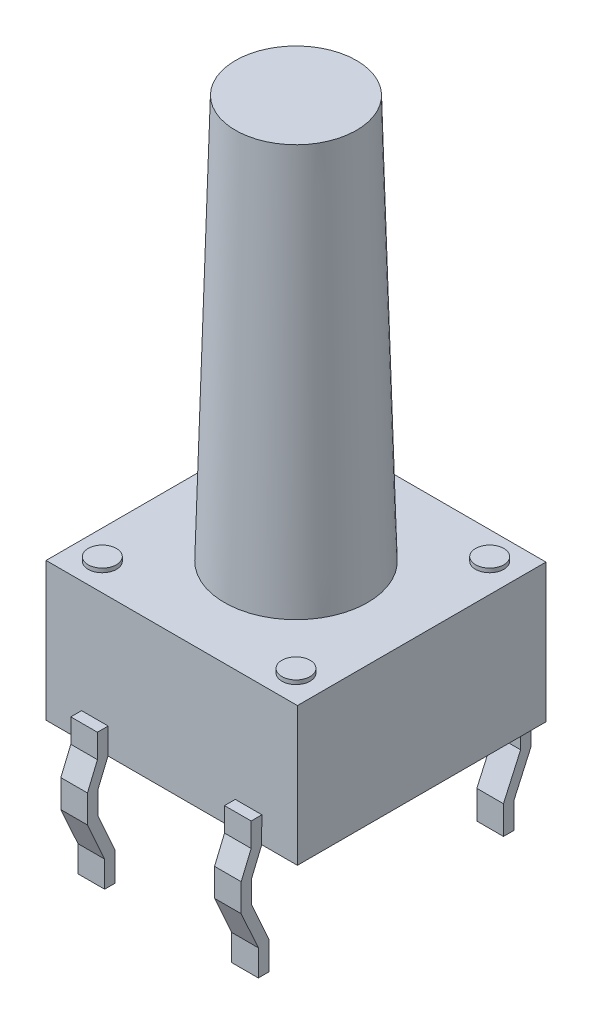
ISO-10303-21;
HEADER;
FILE_DESCRIPTION(('STEP AP214'),'2;1');
FILE_NAME('part.step','',(''),(''),'','','');
FILE_SCHEMA(('AUTOMOTIVE_DESIGN { 1 0 10303 214 1 1 1 1 }'));
ENDSEC;
DATA;
#1=APPLICATION_CONTEXT('core data for automotive mechanical design processes');
#2=APPLICATION_PROTOCOL_DEFINITION('international standard','automotive_design',2000,#1);
#3=PRODUCT_CONTEXT('',#1,'mechanical');
#4=PRODUCT('Part','Part','',(#3));
#5=PRODUCT_RELATED_PRODUCT_CATEGORY('part','',(#4));
#6=PRODUCT_DEFINITION_FORMATION('','',#4);
#7=PRODUCT_DEFINITION_CONTEXT('part definition',#1,'design');
#8=PRODUCT_DEFINITION('design','',#6,#7);
#9=PRODUCT_DEFINITION_SHAPE('','',#8);
#10=(LENGTH_UNIT() NAMED_UNIT(*) SI_UNIT(.MILLI.,.METRE.));
#11=(NAMED_UNIT(*) PLANE_ANGLE_UNIT() SI_UNIT($,.RADIAN.));
#12=(NAMED_UNIT(*) SI_UNIT($,.STERADIAN.) SOLID_ANGLE_UNIT());
#13=UNCERTAINTY_MEASURE_WITH_UNIT(LENGTH_MEASURE(1.E-05),#10,'distance_accuracy_value','');
#14=(GEOMETRIC_REPRESENTATION_CONTEXT(3) GLOBAL_UNCERTAINTY_ASSIGNED_CONTEXT((#13)) GLOBAL_UNIT_ASSIGNED_CONTEXT((#10,
#11,#12)) REPRESENTATION_CONTEXT('',''));
#15=CARTESIAN_POINT('',(0.,0.,0.));
#16=DIRECTION('',(0.,0.,1.));
#17=DIRECTION('',(1.,0.,0.));
#18=AXIS2_PLACEMENT_3D('',#15,#16,#17);
#19=CARTESIAN_POINT('',(-3.115,3.43,-3.08));
#20=DIRECTION('',(0.,-1.,0.));
#21=DIRECTION('',(0.,0.,-1.));
#22=AXIS2_PLACEMENT_3D('',#19,#20,#21);
#23=PLANE('',#22);
#24=CARTESIAN_POINT('',(-2.40002529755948,3.43,2.40002529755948));
#25=DIRECTION('',(0.,-1.,0.));
#26=DIRECTION('',(0.,0.,-1.));
#27=AXIS2_PLACEMENT_3D('',#24,#25,#26);
#28=CIRCLE('',#27,0.350000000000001);
#29=CARTESIAN_POINT('',(-2.40002529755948,3.43,2.05002529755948));
#30=VERTEX_POINT('',#29);
#31=EDGE_CURVE('E60',#30,#30,#28,.F.);
#32=ORIENTED_EDGE('',*,*,#31,.F.);
#33=EDGE_LOOP('',(#32));
#34=FACE_BOUND('',#33,.T.);
#35=CARTESIAN_POINT('',(2.40002529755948,3.43,-2.40002529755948));
#36=DIRECTION('',(0.,-1.,0.));
#37=DIRECTION('',(0.,0.,-1.));
#38=AXIS2_PLACEMENT_3D('',#35,#36,#37);
#39=CIRCLE('',#38,0.350000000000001);
#40=CARTESIAN_POINT('',(2.40002529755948,3.43,-2.75002529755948));
#41=VERTEX_POINT('',#40);
#42=EDGE_CURVE('E936',#41,#41,#39,.F.);
#43=ORIENTED_EDGE('',*,*,#42,.F.);
#44=EDGE_LOOP('',(#43));
#45=FACE_BOUND('',#44,.T.);
#46=DIRECTION('',(0.,0.,1.));
#47=VECTOR('',#46,1.);
#48=CARTESIAN_POINT('',(-3.115,3.43,3.08));
#49=LINE('',#48,#47);
#50=CARTESIAN_POINT('',(-3.115,3.43,-3.08));
#51=VERTEX_POINT('',#50);
#52=CARTESIAN_POINT('',(-3.115,3.43,3.08));
#53=VERTEX_POINT('',#52);
#54=EDGE_CURVE('E912',#51,#53,#49,.T.);
#55=ORIENTED_EDGE('',*,*,#54,.T.);
#56=DIRECTION('',(1.,0.,0.));
#57=VECTOR('',#56,1.);
#58=CARTESIAN_POINT('',(-3.115,3.43,3.08));
#59=LINE('',#58,#57);
#60=CARTESIAN_POINT('',(3.115,3.43,3.08));
#61=VERTEX_POINT('',#60);
#62=EDGE_CURVE('E915',#53,#61,#59,.T.);
#63=ORIENTED_EDGE('',*,*,#62,.T.);
#64=DIRECTION('',(0.,0.,-1.));
#65=VECTOR('',#64,1.);
#66=CARTESIAN_POINT('',(3.115,3.43,3.08));
#67=LINE('',#66,#65);
#68=CARTESIAN_POINT('',(3.115,3.43,-3.08));
#69=VERTEX_POINT('',#68);
#70=EDGE_CURVE('E917',#61,#69,#67,.T.);
#71=ORIENTED_EDGE('',*,*,#70,.T.);
#72=DIRECTION('',(-1.,0.,0.));
#73=VECTOR('',#72,1.);
#74=CARTESIAN_POINT('',(-3.115,3.43,-3.08));
#75=LINE('',#74,#73);
#76=EDGE_CURVE('E919',#69,#51,#75,.T.);
#77=ORIENTED_EDGE('',*,*,#76,.T.);
#78=EDGE_LOOP('',(#55,#63,#71,#77));
#79=FACE_BOUND('',#78,.T.);
#80=CARTESIAN_POINT('',(2.40002529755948,3.43,2.40002529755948));
#81=DIRECTION('',(0.,-1.,0.));
#82=DIRECTION('',(0.,0.,-1.));
#83=AXIS2_PLACEMENT_3D('',#80,#81,#82);
#84=CIRCLE('',#83,0.350000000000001);
#85=CARTESIAN_POINT('',(2.40002529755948,3.43,2.05002529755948));
#86=VERTEX_POINT('',#85);
#87=EDGE_CURVE('E933',#86,#86,#84,.F.);
#88=ORIENTED_EDGE('',*,*,#87,.F.);
#89=EDGE_LOOP('',(#88));
#90=FACE_BOUND('',#89,.T.);
#91=CARTESIAN_POINT('',(-2.40002529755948,3.43,-2.40002529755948));
#92=DIRECTION('',(0.,-1.,0.));
#93=DIRECTION('',(0.,0.,-1.));
#94=AXIS2_PLACEMENT_3D('',#91,#92,#93);
#95=CIRCLE('',#94,0.350000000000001);
#96=CARTESIAN_POINT('',(-2.40002529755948,3.43,-2.75002529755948));
#97=VERTEX_POINT('',#96);
#98=EDGE_CURVE('E939',#97,#97,#95,.F.);
#99=ORIENTED_EDGE('',*,*,#98,.F.);
#100=EDGE_LOOP('',(#99));
#101=FACE_BOUND('',#100,.T.);
#102=CARTESIAN_POINT('',(0.,3.43,0.));
#103=DIRECTION('',(0.,-1.,0.));
#104=DIRECTION('',(0.,0.,-1.));
#105=AXIS2_PLACEMENT_3D('',#102,#103,#104);
#106=CIRCLE('',#105,1.775);
#107=CARTESIAN_POINT('',(0.,3.43,-1.775));
#108=VERTEX_POINT('',#107);
#109=EDGE_CURVE('E12',#108,#108,#106,.F.);
#110=ORIENTED_EDGE('',*,*,#109,.F.);
#111=EDGE_LOOP('',(#110));
#112=FACE_BOUND('',#111,.T.);
#113=ADVANCED_FACE('F52',(#34,#45,#79,#90,#101,#112),#23,.F.);
#114=CARTESIAN_POINT('',(-3.115,3.43,-3.08));
#115=DIRECTION('',(0.,0.,1.));
#116=DIRECTION('',(1.,0.,0.));
#117=AXIS2_PLACEMENT_3D('',#114,#115,#116);
#118=PLANE('',#117);
#119=DIRECTION('',(-1.,0.,0.));
#120=VECTOR('',#119,1.);
#121=CARTESIAN_POINT('',(-3.115,0.,-3.08));
#122=LINE('',#121,#120);
#123=CARTESIAN_POINT('',(3.115,0.,-3.08));
#124=VERTEX_POINT('',#123);
#125=CARTESIAN_POINT('',(-3.115,0.,-3.08));
#126=VERTEX_POINT('',#125);
#127=EDGE_CURVE('E910',#124,#126,#122,.T.);
#128=ORIENTED_EDGE('',*,*,#127,.T.);
#129=DIRECTION('',(0.,-1.,0.));
#130=VECTOR('',#129,1.);
#131=CARTESIAN_POINT('',(-3.115,3.43,-3.08));
#132=LINE('',#131,#130);
#133=EDGE_CURVE('E921',#51,#126,#132,.T.);
#134=ORIENTED_EDGE('',*,*,#133,.F.);
#135=ORIENTED_EDGE('',*,*,#76,.F.);
#136=DIRECTION('',(0.,-1.,0.));
#137=VECTOR('',#136,1.);
#138=CARTESIAN_POINT('',(3.115,3.43,-3.08));
#139=LINE('',#138,#137);
#140=EDGE_CURVE('E924',#69,#124,#139,.T.);
#141=ORIENTED_EDGE('',*,*,#140,.T.);
#142=EDGE_LOOP('',(#128,#134,#135,#141));
#143=FACE_BOUND('',#142,.T.);
#144=DIRECTION('',(-1.,0.,0.));
#145=VECTOR('',#144,1.);
#146=CARTESIAN_POINT('',(1.575,0.645886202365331,-3.08));
#147=LINE('',#146,#145);
#148=CARTESIAN_POINT('',(2.235,0.645886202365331,-3.08));
#149=VERTEX_POINT('',#148);
#150=CARTESIAN_POINT('',(1.575,0.645886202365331,-3.08));
#151=VERTEX_POINT('',#150);
#152=EDGE_CURVE('E583',#149,#151,#147,.T.);
#153=ORIENTED_EDGE('',*,*,#152,.T.);
#154=DIRECTION('',(0.,-1.,0.));
#155=VECTOR('',#154,1.);
#156=CARTESIAN_POINT('',(1.575,0.645886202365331,-3.08));
#157=LINE('',#156,#155);
#158=CARTESIAN_POINT('',(1.575,0.384426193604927,-3.08));
#159=VERTEX_POINT('',#158);
#160=EDGE_CURVE('E580',#151,#159,#157,.T.);
#161=ORIENTED_EDGE('',*,*,#160,.T.);
#162=DIRECTION('',(1.,0.,0.));
#163=VECTOR('',#162,1.);
#164=CARTESIAN_POINT('',(1.575,0.384426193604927,-3.08));
#165=LINE('',#164,#163);
#166=CARTESIAN_POINT('',(2.235,0.384426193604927,-3.08));
#167=VERTEX_POINT('',#166);
#168=EDGE_CURVE('E590',#159,#167,#165,.T.);
#169=ORIENTED_EDGE('',*,*,#168,.T.);
#170=DIRECTION('',(0.,1.,0.));
#171=VECTOR('',#170,1.);
#172=CARTESIAN_POINT('',(2.235,0.645886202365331,-3.08));
#173=LINE('',#172,#171);
#174=EDGE_CURVE('E587',#167,#149,#173,.T.);
#175=ORIENTED_EDGE('',*,*,#174,.T.);
#176=EDGE_LOOP('',(#153,#161,#169,#175));
#177=FACE_BOUND('',#176,.T.);
#178=DIRECTION('',(1.,0.,0.));
#179=VECTOR('',#178,1.);
#180=CARTESIAN_POINT('',(-1.575,0.645886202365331,-3.08));
#181=LINE('',#180,#179);
#182=CARTESIAN_POINT('',(-2.235,0.645886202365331,-3.08));
#183=VERTEX_POINT('',#182);
#184=CARTESIAN_POINT('',(-1.575,0.645886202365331,-3.08));
#185=VERTEX_POINT('',#184);
#186=EDGE_CURVE('E67',#183,#185,#181,.T.);
#187=ORIENTED_EDGE('',*,*,#186,.F.);
#188=DIRECTION('',(0.,1.,0.));
#189=VECTOR('',#188,1.);
#190=CARTESIAN_POINT('',(-2.235,0.645886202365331,-3.08));
#191=LINE('',#190,#189);
#192=CARTESIAN_POINT('',(-2.235,0.384426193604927,-3.08));
#193=VERTEX_POINT('',#192);
#194=EDGE_CURVE('E72',#193,#183,#191,.T.);
#195=ORIENTED_EDGE('',*,*,#194,.F.);
#196=DIRECTION('',(-1.,0.,0.));
#197=VECTOR('',#196,1.);
#198=CARTESIAN_POINT('',(-1.575,0.384426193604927,-3.08));
#199=LINE('',#198,#197);
#200=CARTESIAN_POINT('',(-1.575,0.384426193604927,-3.08));
#201=VERTEX_POINT('',#200);
#202=EDGE_CURVE('E426',#201,#193,#199,.T.);
#203=ORIENTED_EDGE('',*,*,#202,.F.);
#204=DIRECTION('',(0.,-1.,0.));
#205=VECTOR('',#204,1.);
#206=CARTESIAN_POINT('',(-1.575,0.645886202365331,-3.08));
#207=LINE('',#206,#205);
#208=EDGE_CURVE('E430',#185,#201,#207,.T.);
#209=ORIENTED_EDGE('',*,*,#208,.F.);
#210=EDGE_LOOP('',(#187,#195,#203,#209));
#211=FACE_BOUND('',#210,.T.);
#212=ADVANCED_FACE('F428',(#143,#177,#211),#118,.F.);
#213=CARTESIAN_POINT('',(-3.115,3.43,3.08));
#214=DIRECTION('',(0.,0.,-1.));
#215=DIRECTION('',(-1.,0.,0.));
#216=AXIS2_PLACEMENT_3D('',#213,#214,#215);
#217=PLANE('',#216);
#218=DIRECTION('',(1.,0.,0.));
#219=VECTOR('',#218,1.);
#220=CARTESIAN_POINT('',(-1.575,0.645886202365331,3.08));
#221=LINE('',#220,#219);
#222=CARTESIAN_POINT('',(-2.235,0.645886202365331,3.08));
#223=VERTEX_POINT('',#222);
#224=CARTESIAN_POINT('',(-1.575,0.645886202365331,3.08));
#225=VERTEX_POINT('',#224);
#226=EDGE_CURVE('E703',#223,#225,#221,.T.);
#227=ORIENTED_EDGE('',*,*,#226,.T.);
#228=DIRECTION('',(0.,-1.,0.));
#229=VECTOR('',#228,1.);
#230=CARTESIAN_POINT('',(-1.575,0.645886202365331,3.08));
#231=LINE('',#230,#229);
#232=CARTESIAN_POINT('',(-1.575,0.384426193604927,3.08));
#233=VERTEX_POINT('',#232);
#234=EDGE_CURVE('E658',#225,#233,#231,.T.);
#235=ORIENTED_EDGE('',*,*,#234,.T.);
#236=DIRECTION('',(-1.,0.,0.));
#237=VECTOR('',#236,1.);
#238=CARTESIAN_POINT('',(-1.575,0.384426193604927,3.08));
#239=LINE('',#238,#237);
#240=CARTESIAN_POINT('',(-2.235,0.384426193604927,3.08));
#241=VERTEX_POINT('',#240);
#242=EDGE_CURVE('E709',#233,#241,#239,.T.);
#243=ORIENTED_EDGE('',*,*,#242,.T.);
#244=DIRECTION('',(0.,1.,0.));
#245=VECTOR('',#244,1.);
#246=CARTESIAN_POINT('',(-2.235,0.645886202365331,3.08));
#247=LINE('',#246,#245);
#248=EDGE_CURVE('E706',#241,#223,#247,.T.);
#249=ORIENTED_EDGE('',*,*,#248,.T.);
#250=EDGE_LOOP('',(#227,#235,#243,#249));
#251=FACE_BOUND('',#250,.T.);
#252=DIRECTION('',(1.,0.,0.));
#253=VECTOR('',#252,1.);
#254=CARTESIAN_POINT('',(-3.115,0.,3.08));
#255=LINE('',#254,#253);
#256=CARTESIAN_POINT('',(-3.115,0.,3.08));
#257=VERTEX_POINT('',#256);
#258=CARTESIAN_POINT('',(3.115,0.,3.08));
#259=VERTEX_POINT('',#258);
#260=EDGE_CURVE('E906',#257,#259,#255,.T.);
#261=ORIENTED_EDGE('',*,*,#260,.T.);
#262=DIRECTION('',(0.,-1.,0.));
#263=VECTOR('',#262,1.);
#264=CARTESIAN_POINT('',(3.115,3.43,3.08));
#265=LINE('',#264,#263);
#266=EDGE_CURVE('E927',#61,#259,#265,.T.);
#267=ORIENTED_EDGE('',*,*,#266,.F.);
#268=ORIENTED_EDGE('',*,*,#62,.F.);
#269=DIRECTION('',(0.,-1.,0.));
#270=VECTOR('',#269,1.);
#271=CARTESIAN_POINT('',(-3.115,3.43,3.08));
#272=LINE('',#271,#270);
#273=EDGE_CURVE('E930',#53,#257,#272,.T.);
#274=ORIENTED_EDGE('',*,*,#273,.T.);
#275=EDGE_LOOP('',(#261,#267,#268,#274));
#276=FACE_BOUND('',#275,.T.);
#277=DIRECTION('',(-1.,0.,0.));
#278=VECTOR('',#277,1.);
#279=CARTESIAN_POINT('',(1.575,0.645886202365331,3.08));
#280=LINE('',#279,#278);
#281=CARTESIAN_POINT('',(2.235,0.645886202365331,3.08));
#282=VERTEX_POINT('',#281);
#283=CARTESIAN_POINT('',(1.575,0.645886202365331,3.08));
#284=VERTEX_POINT('',#283);
#285=EDGE_CURVE('E831',#282,#284,#280,.T.);
#286=ORIENTED_EDGE('',*,*,#285,.F.);
#287=DIRECTION('',(0.,1.,0.));
#288=VECTOR('',#287,1.);
#289=CARTESIAN_POINT('',(2.235,0.645886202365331,3.08));
#290=LINE('',#289,#288);
#291=CARTESIAN_POINT('',(2.235,0.384426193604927,3.08));
#292=VERTEX_POINT('',#291);
#293=EDGE_CURVE('E828',#292,#282,#290,.T.);
#294=ORIENTED_EDGE('',*,*,#293,.F.);
#295=DIRECTION('',(1.,0.,0.));
#296=VECTOR('',#295,1.);
#297=CARTESIAN_POINT('',(1.575,0.384426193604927,3.08));
#298=LINE('',#297,#296);
#299=CARTESIAN_POINT('',(1.575,0.384426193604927,3.08));
#300=VERTEX_POINT('',#299);
#301=EDGE_CURVE('E825',#300,#292,#298,.T.);
#302=ORIENTED_EDGE('',*,*,#301,.F.);
#303=DIRECTION('',(0.,-1.,0.));
#304=VECTOR('',#303,1.);
#305=CARTESIAN_POINT('',(1.575,0.645886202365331,3.08));
#306=LINE('',#305,#304);
#307=EDGE_CURVE('E777',#284,#300,#306,.T.);
#308=ORIENTED_EDGE('',*,*,#307,.F.);
#309=EDGE_LOOP('',(#286,#294,#302,#308));
#310=FACE_BOUND('',#309,.T.);
#311=ADVANCED_FACE('F1242',(#251,#276,#310),#217,.F.);
#312=CARTESIAN_POINT('',(-3.115,3.43,3.08));
#313=DIRECTION('',(1.,0.,0.));
#314=DIRECTION('',(0.,0.,-1.));
#315=AXIS2_PLACEMENT_3D('',#312,#313,#314);
#316=PLANE('',#315);
#317=DIRECTION('',(0.,0.,1.));
#318=VECTOR('',#317,1.);
#319=CARTESIAN_POINT('',(-3.115,0.,3.08));
#320=LINE('',#319,#318);
#321=EDGE_CURVE('E781',#126,#257,#320,.T.);
#322=ORIENTED_EDGE('',*,*,#321,.T.);
#323=ORIENTED_EDGE('',*,*,#273,.F.);
#324=ORIENTED_EDGE('',*,*,#54,.F.);
#325=ORIENTED_EDGE('',*,*,#133,.T.);
#326=EDGE_LOOP('',(#322,#323,#324,#325));
#327=FACE_BOUND('',#326,.T.);
#328=ADVANCED_FACE('F54',(#327),#316,.F.);
#329=CARTESIAN_POINT('',(3.115,3.43,3.08));
#330=DIRECTION('',(-1.,0.,0.));
#331=DIRECTION('',(0.,0.,1.));
#332=AXIS2_PLACEMENT_3D('',#329,#330,#331);
#333=PLANE('',#332);
#334=DIRECTION('',(0.,0.,-1.));
#335=VECTOR('',#334,1.);
#336=CARTESIAN_POINT('',(3.115,0.,3.08));
#337=LINE('',#336,#335);
#338=EDGE_CURVE('E908',#259,#124,#337,.T.);
#339=ORIENTED_EDGE('',*,*,#338,.T.);
#340=ORIENTED_EDGE('',*,*,#140,.F.);
#341=ORIENTED_EDGE('',*,*,#70,.F.);
#342=ORIENTED_EDGE('',*,*,#266,.T.);
#343=EDGE_LOOP('',(#339,#340,#341,#342));
#344=FACE_BOUND('',#343,.T.);
#345=ADVANCED_FACE('F1237',(#344),#333,.F.);
#346=CARTESIAN_POINT('',(-3.115,0.,-3.08));
#347=DIRECTION('',(0.,-1.,0.));
#348=DIRECTION('',(0.,0.,-1.));
#349=AXIS2_PLACEMENT_3D('',#346,#347,#348);
#350=PLANE('',#349);
#351=ORIENTED_EDGE('',*,*,#321,.F.);
#352=ORIENTED_EDGE('',*,*,#127,.F.);
#353=ORIENTED_EDGE('',*,*,#338,.F.);
#354=ORIENTED_EDGE('',*,*,#260,.F.);
#355=EDGE_LOOP('',(#351,#352,#353,#354));
#356=FACE_BOUND('',#355,.T.);
#357=ADVANCED_FACE('F1231',(#356),#350,.T.);
#358=CARTESIAN_POINT('',(1.575,-2.11005964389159,2.90682182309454));
#359=DIRECTION('',(0.,0.,-1.));
#360=DIRECTION('',(-1.,0.,0.));
#361=AXIS2_PLACEMENT_3D('',#358,#359,#360);
#362=PLANE('',#361);
#363=DIRECTION('',(0.,-1.,0.));
#364=VECTOR('',#363,1.);
#365=CARTESIAN_POINT('',(2.235,-2.11005964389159,2.90682182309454));
#366=LINE('',#365,#364);
#367=CARTESIAN_POINT('',(2.235,-2.11005964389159,2.90682182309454));
#368=VERTEX_POINT('',#367);
#369=CARTESIAN_POINT('',(2.235,-2.81378627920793,2.90682182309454));
#370=VERTEX_POINT('',#369);
#371=EDGE_CURVE('E899',#368,#370,#366,.T.);
#372=ORIENTED_EDGE('',*,*,#371,.T.);
#373=DIRECTION('',(-1.,0.,0.));
#374=VECTOR('',#373,1.);
#375=CARTESIAN_POINT('',(1.575,-2.81378627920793,2.90682182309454));
#376=LINE('',#375,#374);
#377=CARTESIAN_POINT('',(1.575,-2.81378627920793,2.90682182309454));
#378=VERTEX_POINT('',#377);
#379=EDGE_CURVE('E785',#370,#378,#376,.T.);
#380=ORIENTED_EDGE('',*,*,#379,.T.);
#381=DIRECTION('',(0.,-1.,0.));
#382=VECTOR('',#381,1.);
#383=CARTESIAN_POINT('',(1.575,-2.11005964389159,2.90682182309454));
#384=LINE('',#383,#382);
#385=CARTESIAN_POINT('',(1.575,-2.11005964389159,2.90682182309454));
#386=VERTEX_POINT('',#385);
#387=EDGE_CURVE('E796',#386,#378,#384,.T.);
#388=ORIENTED_EDGE('',*,*,#387,.F.);
#389=DIRECTION('',(1.,0.,0.));
#390=VECTOR('',#389,1.);
#391=CARTESIAN_POINT('',(1.575,-2.11005964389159,2.90682182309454));
#392=LINE('',#391,#390);
#393=EDGE_CURVE('E792',#386,#368,#392,.T.);
#394=ORIENTED_EDGE('',*,*,#393,.T.);
#395=EDGE_LOOP('',(#372,#380,#388,#394));
#396=FACE_BOUND('',#395,.T.);
#397=ADVANCED_FACE('F1228',(#396),#362,.T.);
#398=CARTESIAN_POINT('',(1.575,-2.16619332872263,3.16828183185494));
#399=DIRECTION('',(0.,0.,1.));
#400=DIRECTION('',(1.,0.,0.));
#401=AXIS2_PLACEMENT_3D('',#398,#399,#400);
#402=PLANE('',#401);
#403=DIRECTION('',(0.,-1.,0.));
#404=VECTOR('',#403,1.);
#405=CARTESIAN_POINT('',(1.575,-2.16619332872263,3.16828183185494));
#406=LINE('',#405,#404);
#407=CARTESIAN_POINT('',(1.575,-2.16619332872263,3.16828183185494));
#408=VERTEX_POINT('',#407);
#409=CARTESIAN_POINT('',(1.575,-2.81378627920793,3.16828183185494));
#410=VERTEX_POINT('',#409);
#411=EDGE_CURVE('E893',#408,#410,#406,.T.);
#412=ORIENTED_EDGE('',*,*,#411,.T.);
#413=DIRECTION('',(1.,0.,0.));
#414=VECTOR('',#413,1.);
#415=CARTESIAN_POINT('',(1.575,-2.81378627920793,3.16828183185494));
#416=LINE('',#415,#414);
#417=CARTESIAN_POINT('',(2.235,-2.81378627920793,3.16828183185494));
#418=VERTEX_POINT('',#417);
#419=EDGE_CURVE('E778',#410,#418,#416,.T.);
#420=ORIENTED_EDGE('',*,*,#419,.T.);
#421=DIRECTION('',(0.,-1.,0.));
#422=VECTOR('',#421,1.);
#423=CARTESIAN_POINT('',(2.235,-2.16619332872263,3.16828183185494));
#424=LINE('',#423,#422);
#425=CARTESIAN_POINT('',(2.235,-2.16619332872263,3.16828183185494));
#426=VERTEX_POINT('',#425);
#427=EDGE_CURVE('E896',#426,#418,#424,.T.);
#428=ORIENTED_EDGE('',*,*,#427,.F.);
#429=DIRECTION('',(-1.,0.,0.));
#430=VECTOR('',#429,1.);
#431=CARTESIAN_POINT('',(1.575,-2.16619332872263,3.16828183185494));
#432=LINE('',#431,#430);
#433=EDGE_CURVE('E789',#426,#408,#432,.T.);
#434=ORIENTED_EDGE('',*,*,#433,.T.);
#435=EDGE_LOOP('',(#412,#420,#428,#434));
#436=FACE_BOUND('',#435,.T.);
#437=ADVANCED_FACE('F1223',(#436),#402,.T.);
#438=CARTESIAN_POINT('',(1.575,-1.16565595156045,3.33193052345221));
#439=DIRECTION('',(0.,-0.41046668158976,0.911875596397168));
#440=DIRECTION('',(0.,-0.911875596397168,-0.41046668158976));
#441=AXIS2_PLACEMENT_3D('',#438,#439,#440);
#442=PLANE('',#441);
#443=ORIENTED_EDGE('',*,*,#393,.F.);
#444=DIRECTION('',(0.,-0.911875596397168,-0.41046668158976));
#445=VECTOR('',#444,1.);
#446=CARTESIAN_POINT('',(1.575,-1.16565595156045,3.33193052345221));
#447=LINE('',#446,#445);
#448=CARTESIAN_POINT('',(1.575,-1.16565595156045,3.33193052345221));
#449=VERTEX_POINT('',#448);
#450=EDGE_CURVE('E800',#449,#386,#447,.T.);
#451=ORIENTED_EDGE('',*,*,#450,.F.);
#452=DIRECTION('',(-1.,0.,0.));
#453=VECTOR('',#452,1.);
#454=CARTESIAN_POINT('',(1.575,-1.16565595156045,3.33193052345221));
#455=LINE('',#454,#453);
#456=CARTESIAN_POINT('',(2.235,-1.16565595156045,3.33193052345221));
#457=VERTEX_POINT('',#456);
#458=EDGE_CURVE('E801',#457,#449,#455,.T.);
#459=ORIENTED_EDGE('',*,*,#458,.F.);
#460=DIRECTION('',(0.,-0.911875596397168,-0.41046668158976));
#461=VECTOR('',#460,1.);
#462=CARTESIAN_POINT('',(2.235,-1.16565595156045,3.33193052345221));
#463=LINE('',#462,#461);
#464=EDGE_CURVE('E793',#457,#368,#463,.T.);
#465=ORIENTED_EDGE('',*,*,#464,.T.);
#466=EDGE_LOOP('',(#443,#451,#459,#465));
#467=FACE_BOUND('',#466,.T.);
#468=ADVANCED_FACE('F1220',(#467),#442,.F.);
#469=CARTESIAN_POINT('',(1.575,-1.22178963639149,3.59339053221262));
#470=DIRECTION('',(0.,0.41046668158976,-0.911875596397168));
#471=DIRECTION('',(0.,0.911875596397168,0.41046668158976));
#472=AXIS2_PLACEMENT_3D('',#469,#470,#471);
#473=PLANE('',#472);
#474=ORIENTED_EDGE('',*,*,#433,.F.);
#475=DIRECTION('',(0.,-0.911875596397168,-0.41046668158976));
#476=VECTOR('',#475,1.);
#477=CARTESIAN_POINT('',(2.235,-1.22178963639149,3.59339053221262));
#478=LINE('',#477,#476);
#479=CARTESIAN_POINT('',(2.235,-1.22178963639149,3.59339053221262));
#480=VERTEX_POINT('',#479);
#481=EDGE_CURVE('E886',#480,#426,#478,.T.);
#482=ORIENTED_EDGE('',*,*,#481,.F.);
#483=DIRECTION('',(1.,0.,0.));
#484=VECTOR('',#483,1.);
#485=CARTESIAN_POINT('',(1.575,-1.22178963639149,3.59339053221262));
#486=LINE('',#485,#484);
#487=CARTESIAN_POINT('',(1.575,-1.22178963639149,3.59339053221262));
#488=VERTEX_POINT('',#487);
#489=EDGE_CURVE('E797',#488,#480,#486,.T.);
#490=ORIENTED_EDGE('',*,*,#489,.F.);
#491=DIRECTION('',(0.,-0.911875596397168,-0.41046668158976));
#492=VECTOR('',#491,1.);
#493=CARTESIAN_POINT('',(1.575,-1.22178963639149,3.59339053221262));
#494=LINE('',#493,#492);
#495=EDGE_CURVE('E883',#488,#408,#494,.T.);
#496=ORIENTED_EDGE('',*,*,#495,.T.);
#497=EDGE_LOOP('',(#474,#482,#490,#496));
#498=FACE_BOUND('',#497,.T.);
#499=ADVANCED_FACE('F1215',(#498),#473,.F.);
#500=CARTESIAN_POINT('',(1.575,-0.53453060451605,3.59339053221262));
#501=DIRECTION('',(0.,0.,1.));
#502=DIRECTION('',(1.,0.,0.));
#503=AXIS2_PLACEMENT_3D('',#500,#501,#502);
#504=PLANE('',#503);
#505=DIRECTION('',(0.,-1.,0.));
#506=VECTOR('',#505,1.);
#507=CARTESIAN_POINT('',(1.575,-0.53453060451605,3.59339053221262));
#508=LINE('',#507,#506);
#509=CARTESIAN_POINT('',(1.575,-0.53453060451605,3.59339053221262));
#510=VERTEX_POINT('',#509);
#511=EDGE_CURVE('E867',#510,#488,#508,.T.);
#512=ORIENTED_EDGE('',*,*,#511,.T.);
#513=ORIENTED_EDGE('',*,*,#489,.T.);
#514=DIRECTION('',(0.,-1.,0.));
#515=VECTOR('',#514,1.);
#516=CARTESIAN_POINT('',(2.235,-0.53453060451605,3.59339053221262));
#517=LINE('',#516,#515);
#518=CARTESIAN_POINT('',(2.235,-0.53453060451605,3.59339053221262));
#519=VERTEX_POINT('',#518);
#520=EDGE_CURVE('E870',#519,#480,#517,.T.);
#521=ORIENTED_EDGE('',*,*,#520,.F.);
#522=DIRECTION('',(-1.,0.,0.));
#523=VECTOR('',#522,1.);
#524=CARTESIAN_POINT('',(1.575,-0.53453060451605,3.59339053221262));
#525=LINE('',#524,#523);
#526=EDGE_CURVE('E802',#519,#510,#525,.T.);
#527=ORIENTED_EDGE('',*,*,#526,.T.);
#528=EDGE_LOOP('',(#512,#513,#521,#527));
#529=FACE_BOUND('',#528,.T.);
#530=ADVANCED_FACE('F1212',(#529),#504,.T.);
#531=CARTESIAN_POINT('',(1.575,-0.586904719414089,3.33193052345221));
#532=DIRECTION('',(0.,0.,-1.));
#533=DIRECTION('',(-1.,0.,0.));
#534=AXIS2_PLACEMENT_3D('',#531,#532,#533);
#535=PLANE('',#534);
#536=DIRECTION('',(0.,-1.,0.));
#537=VECTOR('',#536,1.);
#538=CARTESIAN_POINT('',(2.235,-0.586904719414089,3.33193052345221));
#539=LINE('',#538,#537);
#540=CARTESIAN_POINT('',(2.235,-0.586904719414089,3.33193052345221));
#541=VERTEX_POINT('',#540);
#542=EDGE_CURVE('E873',#541,#457,#539,.T.);
#543=ORIENTED_EDGE('',*,*,#542,.T.);
#544=ORIENTED_EDGE('',*,*,#458,.T.);
#545=DIRECTION('',(0.,-1.,0.));
#546=VECTOR('',#545,1.);
#547=CARTESIAN_POINT('',(1.575,-0.586904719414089,3.33193052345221));
#548=LINE('',#547,#546);
#549=CARTESIAN_POINT('',(1.575,-0.586904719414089,3.33193052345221));
#550=VERTEX_POINT('',#549);
#551=EDGE_CURVE('E876',#550,#449,#548,.T.);
#552=ORIENTED_EDGE('',*,*,#551,.F.);
#553=DIRECTION('',(1.,0.,0.));
#554=VECTOR('',#553,1.);
#555=CARTESIAN_POINT('',(1.575,-0.586904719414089,3.33193052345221));
#556=LINE('',#555,#554);
#557=EDGE_CURVE('E805',#550,#541,#556,.T.);
#558=ORIENTED_EDGE('',*,*,#557,.T.);
#559=EDGE_LOOP('',(#543,#544,#552,#558));
#560=FACE_BOUND('',#559,.T.);
#561=ADVANCED_FACE('F1207',(#560),#535,.T.);
#562=CARTESIAN_POINT('',(1.575,0.0565481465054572,3.34668867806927));
#563=DIRECTION('',(0.,-0.385172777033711,-0.922844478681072));
#564=DIRECTION('',(0.,0.922844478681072,-0.385172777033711));
#565=AXIS2_PLACEMENT_3D('',#562,#563,#564);
#566=PLANE('',#565);
#567=ORIENTED_EDGE('',*,*,#526,.F.);
#568=DIRECTION('',(0.,-0.922844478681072,0.385172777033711));
#569=VECTOR('',#568,1.);
#570=CARTESIAN_POINT('',(2.235,0.0565481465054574,3.34668867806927));
#571=LINE('',#570,#569);
#572=CARTESIAN_POINT('',(2.235,0.0565481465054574,3.34668867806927));
#573=VERTEX_POINT('',#572);
#574=EDGE_CURVE('E857',#573,#519,#571,.T.);
#575=ORIENTED_EDGE('',*,*,#574,.F.);
#576=DIRECTION('',(1.,0.,0.));
#577=VECTOR('',#576,1.);
#578=CARTESIAN_POINT('',(1.575,0.0565481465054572,3.34668867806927));
#579=LINE('',#578,#577);
#580=CARTESIAN_POINT('',(1.575,0.0565481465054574,3.34668867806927));
#581=VERTEX_POINT('',#580);
#582=EDGE_CURVE('E811',#581,#573,#579,.T.);
#583=ORIENTED_EDGE('',*,*,#582,.F.);
#584=DIRECTION('',(0.,-0.922844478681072,0.385172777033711));
#585=VECTOR('',#584,1.);
#586=CARTESIAN_POINT('',(1.575,0.0565481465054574,3.34668867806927));
#587=LINE('',#586,#585);
#588=EDGE_CURVE('E810',#581,#510,#587,.T.);
#589=ORIENTED_EDGE('',*,*,#588,.T.);
#590=EDGE_LOOP('',(#567,#575,#583,#589));
#591=FACE_BOUND('',#590,.T.);
#592=ADVANCED_FACE('F1204',(#591),#566,.F.);
#593=CARTESIAN_POINT('',(1.575,0.00417403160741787,3.08522866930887));
#594=DIRECTION('',(0.,0.385172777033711,0.922844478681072));
#595=DIRECTION('',(0.,-0.922844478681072,0.385172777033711));
#596=AXIS2_PLACEMENT_3D('',#593,#594,#595);
#597=PLANE('',#596);
#598=ORIENTED_EDGE('',*,*,#557,.F.);
#599=DIRECTION('',(0.,-0.922844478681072,0.385172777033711));
#600=VECTOR('',#599,1.);
#601=CARTESIAN_POINT('',(1.575,0.00417403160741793,3.08522866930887));
#602=LINE('',#601,#600);
#603=CARTESIAN_POINT('',(1.575,0.00417403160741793,3.08522866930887));
#604=VERTEX_POINT('',#603);
#605=EDGE_CURVE('E806',#604,#550,#602,.T.);
#606=ORIENTED_EDGE('',*,*,#605,.F.);
#607=DIRECTION('',(-1.,0.,0.));
#608=VECTOR('',#607,1.);
#609=CARTESIAN_POINT('',(1.575,0.00417403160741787,3.08522866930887));
#610=LINE('',#609,#608);
#611=CARTESIAN_POINT('',(2.235,0.00417403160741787,3.08522866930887));
#612=VERTEX_POINT('',#611);
#613=EDGE_CURVE('E807',#612,#604,#610,.T.);
#614=ORIENTED_EDGE('',*,*,#613,.F.);
#615=DIRECTION('',(0.,-0.922844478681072,0.385172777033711));
#616=VECTOR('',#615,1.);
#617=CARTESIAN_POINT('',(2.235,0.00417403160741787,3.08522866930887));
#618=LINE('',#617,#616);
#619=EDGE_CURVE('E860',#612,#541,#618,.T.);
#620=ORIENTED_EDGE('',*,*,#619,.T.);
#621=EDGE_LOOP('',(#598,#606,#614,#620));
#622=FACE_BOUND('',#621,.T.);
#623=ADVANCED_FACE('F1199',(#622),#597,.F.);
#624=CARTESIAN_POINT('',(1.575,0.645886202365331,3.34668867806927));
#625=DIRECTION('',(0.,0.,1.));
#626=DIRECTION('',(1.,0.,0.));
#627=AXIS2_PLACEMENT_3D('',#624,#625,#626);
#628=PLANE('',#627);
#629=DIRECTION('',(0.,-1.,0.));
#630=VECTOR('',#629,1.);
#631=CARTESIAN_POINT('',(1.575,0.645886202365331,3.34668867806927));
#632=LINE('',#631,#630);
#633=CARTESIAN_POINT('',(1.575,0.645886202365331,3.34668867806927));
#634=VERTEX_POINT('',#633);
#635=EDGE_CURVE('E814',#634,#581,#632,.T.);
#636=ORIENTED_EDGE('',*,*,#635,.T.);
#637=ORIENTED_EDGE('',*,*,#582,.T.);
#638=DIRECTION('',(0.,-1.,0.));
#639=VECTOR('',#638,1.);
#640=CARTESIAN_POINT('',(2.235,0.645886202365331,3.34668867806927));
#641=LINE('',#640,#639);
#642=CARTESIAN_POINT('',(2.235,0.645886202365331,3.34668867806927));
#643=VERTEX_POINT('',#642);
#644=EDGE_CURVE('E822',#643,#573,#641,.T.);
#645=ORIENTED_EDGE('',*,*,#644,.F.);
#646=DIRECTION('',(-1.,0.,0.));
#647=VECTOR('',#646,1.);
#648=CARTESIAN_POINT('',(1.575,0.645886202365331,3.34668867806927));
#649=LINE('',#648,#647);
#650=EDGE_CURVE('E818',#643,#634,#649,.T.);
#651=ORIENTED_EDGE('',*,*,#650,.T.);
#652=EDGE_LOOP('',(#636,#637,#645,#651));
#653=FACE_BOUND('',#652,.T.);
#654=ADVANCED_FACE('F1196',(#653),#628,.T.);
#655=CARTESIAN_POINT('',(1.575,0.384426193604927,3.08522866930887));
#656=DIRECTION('',(0.,0.,-1.));
#657=DIRECTION('',(-1.,0.,0.));
#658=AXIS2_PLACEMENT_3D('',#655,#656,#657);
#659=PLANE('',#658);
#660=DIRECTION('',(0.,-1.,0.));
#661=VECTOR('',#660,1.);
#662=CARTESIAN_POINT('',(2.235,0.384426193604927,3.08522866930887));
#663=LINE('',#662,#661);
#664=CARTESIAN_POINT('',(2.235,0.384426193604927,3.08522866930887));
#665=VERTEX_POINT('',#664);
#666=EDGE_CURVE('E847',#665,#612,#663,.T.);
#667=ORIENTED_EDGE('',*,*,#666,.T.);
#668=ORIENTED_EDGE('',*,*,#613,.T.);
#669=DIRECTION('',(0.,-1.,0.));
#670=VECTOR('',#669,1.);
#671=CARTESIAN_POINT('',(1.575,0.384426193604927,3.08522866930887));
#672=LINE('',#671,#670);
#673=CARTESIAN_POINT('',(1.575,0.384426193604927,3.08522866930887));
#674=VERTEX_POINT('',#673);
#675=EDGE_CURVE('E850',#674,#604,#672,.T.);
#676=ORIENTED_EDGE('',*,*,#675,.F.);
#677=DIRECTION('',(1.,0.,0.));
#678=VECTOR('',#677,1.);
#679=CARTESIAN_POINT('',(1.575,0.384426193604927,3.08522866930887));
#680=LINE('',#679,#678);
#681=EDGE_CURVE('E815',#674,#665,#680,.T.);
#682=ORIENTED_EDGE('',*,*,#681,.T.);
#683=EDGE_LOOP('',(#667,#668,#676,#682));
#684=FACE_BOUND('',#683,.T.);
#685=ADVANCED_FACE('F1184',(#684),#659,.T.);
#686=CARTESIAN_POINT('',(1.575,0.645886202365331,3.92586101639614));
#687=DIRECTION('',(0.,-1.,0.));
#688=DIRECTION('',(0.,0.,-1.));
#689=AXIS2_PLACEMENT_3D('',#686,#687,#688);
#690=PLANE('',#689);
#691=ORIENTED_EDGE('',*,*,#650,.F.);
#692=DIRECTION('',(0.,0.,-1.));
#693=VECTOR('',#692,1.);
#694=CARTESIAN_POINT('',(2.235,0.645886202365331,3.92586101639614));
#695=LINE('',#694,#693);
#696=EDGE_CURVE('E837',#643,#282,#695,.T.);
#697=ORIENTED_EDGE('',*,*,#696,.T.);
#698=ORIENTED_EDGE('',*,*,#285,.T.);
#699=DIRECTION('',(0.,0.,-1.));
#700=VECTOR('',#699,1.);
#701=CARTESIAN_POINT('',(1.575,0.645886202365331,3.92586101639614));
#702=LINE('',#701,#700);
#703=EDGE_CURVE('E834',#634,#284,#702,.T.);
#704=ORIENTED_EDGE('',*,*,#703,.F.);
#705=EDGE_LOOP('',(#691,#697,#698,#704));
#706=FACE_BOUND('',#705,.T.);
#707=ADVANCED_FACE('F1180',(#706),#690,.F.);
#708=CARTESIAN_POINT('',(2.235,0.645886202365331,3.92586101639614));
#709=DIRECTION('',(-1.,0.,0.));
#710=DIRECTION('',(0.,0.,1.));
#711=AXIS2_PLACEMENT_3D('',#708,#709,#710);
#712=PLANE('',#711);
#713=ORIENTED_EDGE('',*,*,#696,.F.);
#714=ORIENTED_EDGE('',*,*,#644,.T.);
#715=ORIENTED_EDGE('',*,*,#574,.T.);
#716=ORIENTED_EDGE('',*,*,#520,.T.);
#717=ORIENTED_EDGE('',*,*,#481,.T.);
#718=ORIENTED_EDGE('',*,*,#427,.T.);
#719=DIRECTION('',(0.,0.,-1.));
#720=VECTOR('',#719,1.);
#721=CARTESIAN_POINT('',(2.235,-2.81378627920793,3.5364957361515));
#722=LINE('',#721,#720);
#723=EDGE_CURVE('E788',#418,#370,#722,.T.);
#724=ORIENTED_EDGE('',*,*,#723,.T.);
#725=ORIENTED_EDGE('',*,*,#371,.F.);
#726=ORIENTED_EDGE('',*,*,#464,.F.);
#727=ORIENTED_EDGE('',*,*,#542,.F.);
#728=ORIENTED_EDGE('',*,*,#619,.F.);
#729=ORIENTED_EDGE('',*,*,#666,.F.);
#730=DIRECTION('',(0.,0.,-1.));
#731=VECTOR('',#730,1.);
#732=CARTESIAN_POINT('',(2.235,0.384426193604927,3.92586101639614));
#733=LINE('',#732,#731);
#734=EDGE_CURVE('E840',#665,#292,#733,.T.);
#735=ORIENTED_EDGE('',*,*,#734,.T.);
#736=ORIENTED_EDGE('',*,*,#293,.T.);
#737=EDGE_LOOP('',(#713,#714,#715,#716,#717,#718,#724,#725,#726,#727,#728,#729,#735,#736));
#738=FACE_BOUND('',#737,.T.);
#739=ADVANCED_FACE('F1183',(#738),#712,.F.);
#740=CARTESIAN_POINT('',(1.575,0.384426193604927,3.92586101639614));
#741=DIRECTION('',(0.,1.,0.));
#742=DIRECTION('',(0.,0.,1.));
#743=AXIS2_PLACEMENT_3D('',#740,#741,#742);
#744=PLANE('',#743);
#745=ORIENTED_EDGE('',*,*,#681,.F.);
#746=DIRECTION('',(0.,0.,-1.));
#747=VECTOR('',#746,1.);
#748=CARTESIAN_POINT('',(1.575,0.384426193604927,3.92586101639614));
#749=LINE('',#748,#747);
#750=EDGE_CURVE('E819',#674,#300,#749,.T.);
#751=ORIENTED_EDGE('',*,*,#750,.T.);
#752=ORIENTED_EDGE('',*,*,#301,.T.);
#753=ORIENTED_EDGE('',*,*,#734,.F.);
#754=EDGE_LOOP('',(#745,#751,#752,#753));
#755=FACE_BOUND('',#754,.T.);
#756=ADVANCED_FACE('F1188',(#755),#744,.F.);
#757=CARTESIAN_POINT('',(1.575,0.645886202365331,3.92586101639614));
#758=DIRECTION('',(1.,0.,0.));
#759=DIRECTION('',(0.,0.,-1.));
#760=AXIS2_PLACEMENT_3D('',#757,#758,#759);
#761=PLANE('',#760);
#762=ORIENTED_EDGE('',*,*,#750,.F.);
#763=ORIENTED_EDGE('',*,*,#675,.T.);
#764=ORIENTED_EDGE('',*,*,#605,.T.);
#765=ORIENTED_EDGE('',*,*,#551,.T.);
#766=ORIENTED_EDGE('',*,*,#450,.T.);
#767=ORIENTED_EDGE('',*,*,#387,.T.);
#768=DIRECTION('',(0.,0.,1.));
#769=VECTOR('',#768,1.);
#770=CARTESIAN_POINT('',(1.575,-2.81378627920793,3.5364957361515));
#771=LINE('',#770,#769);
#772=EDGE_CURVE('E782',#378,#410,#771,.T.);
#773=ORIENTED_EDGE('',*,*,#772,.T.);
#774=ORIENTED_EDGE('',*,*,#411,.F.);
#775=ORIENTED_EDGE('',*,*,#495,.F.);
#776=ORIENTED_EDGE('',*,*,#511,.F.);
#777=ORIENTED_EDGE('',*,*,#588,.F.);
#778=ORIENTED_EDGE('',*,*,#635,.F.);
#779=ORIENTED_EDGE('',*,*,#703,.T.);
#780=ORIENTED_EDGE('',*,*,#307,.T.);
#781=EDGE_LOOP('',(#762,#763,#764,#765,#766,#767,#773,#774,#775,#776,#777,#778,#779,#780));
#782=FACE_BOUND('',#781,.T.);
#783=ADVANCED_FACE('F1178',(#782),#761,.F.);
#784=CARTESIAN_POINT('',(1.905,-2.81378627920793,3.03755182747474));
#785=DIRECTION('',(0.,-1.,0.));
#786=DIRECTION('',(0.,0.,-1.));
#787=AXIS2_PLACEMENT_3D('',#784,#785,#786);
#788=PLANE('',#787);
#789=ORIENTED_EDGE('',*,*,#723,.F.);
#790=ORIENTED_EDGE('',*,*,#419,.F.);
#791=ORIENTED_EDGE('',*,*,#772,.F.);
#792=ORIENTED_EDGE('',*,*,#379,.F.);
#793=EDGE_LOOP('',(#789,#790,#791,#792));
#794=FACE_BOUND('',#793,.T.);
#795=ADVANCED_FACE('F1171',(#794),#788,.T.);
#796=CARTESIAN_POINT('',(-1.575,-2.11005964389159,2.90682182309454));
#797=DIRECTION('',(0.,0.,1.));
#798=DIRECTION('',(1.,0.,0.));
#799=AXIS2_PLACEMENT_3D('',#796,#797,#798);
#800=PLANE('',#799);
#801=DIRECTION('',(1.,0.,0.));
#802=VECTOR('',#801,1.);
#803=CARTESIAN_POINT('',(-1.575,-2.81378627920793,2.90682182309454));
#804=LINE('',#803,#802);
#805=CARTESIAN_POINT('',(-2.235,-2.81378627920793,2.90682182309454));
#806=VERTEX_POINT('',#805);
#807=CARTESIAN_POINT('',(-1.575,-2.81378627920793,2.90682182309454));
#808=VERTEX_POINT('',#807);
#809=EDGE_CURVE('E661',#806,#808,#804,.T.);
#810=ORIENTED_EDGE('',*,*,#809,.F.);
#811=DIRECTION('',(0.,-1.,0.));
#812=VECTOR('',#811,1.);
#813=CARTESIAN_POINT('',(-2.235,-2.11005964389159,2.90682182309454));
#814=LINE('',#813,#812);
#815=CARTESIAN_POINT('',(-2.235,-2.11005964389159,2.90682182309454));
#816=VERTEX_POINT('',#815);
#817=EDGE_CURVE('E768',#816,#806,#814,.T.);
#818=ORIENTED_EDGE('',*,*,#817,.F.);
#819=DIRECTION('',(-1.,0.,0.));
#820=VECTOR('',#819,1.);
#821=CARTESIAN_POINT('',(-1.575,-2.11005964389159,2.90682182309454));
#822=LINE('',#821,#820);
#823=CARTESIAN_POINT('',(-1.575,-2.11005964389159,2.90682182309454));
#824=VERTEX_POINT('',#823);
#825=EDGE_CURVE('E671',#824,#816,#822,.T.);
#826=ORIENTED_EDGE('',*,*,#825,.F.);
#827=DIRECTION('',(0.,-1.,0.));
#828=VECTOR('',#827,1.);
#829=CARTESIAN_POINT('',(-1.575,-2.11005964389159,2.90682182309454));
#830=LINE('',#829,#828);
#831=EDGE_CURVE('E670',#824,#808,#830,.T.);
#832=ORIENTED_EDGE('',*,*,#831,.T.);
#833=EDGE_LOOP('',(#810,#818,#826,#832));
#834=FACE_BOUND('',#833,.T.);
#835=ADVANCED_FACE('F1168',(#834),#800,.F.);
#836=CARTESIAN_POINT('',(-1.575,-2.16619332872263,3.16828183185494));
#837=DIRECTION('',(0.,0.,-1.));
#838=DIRECTION('',(-1.,0.,0.));
#839=AXIS2_PLACEMENT_3D('',#836,#837,#838);
#840=PLANE('',#839);
#841=DIRECTION('',(-1.,0.,0.));
#842=VECTOR('',#841,1.);
#843=CARTESIAN_POINT('',(-1.575,-2.81378627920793,3.16828183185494));
#844=LINE('',#843,#842);
#845=CARTESIAN_POINT('',(-1.575,-2.81378627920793,3.16828183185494));
#846=VERTEX_POINT('',#845);
#847=CARTESIAN_POINT('',(-2.235,-2.81378627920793,3.16828183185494));
#848=VERTEX_POINT('',#847);
#849=EDGE_CURVE('E666',#846,#848,#844,.T.);
#850=ORIENTED_EDGE('',*,*,#849,.F.);
#851=DIRECTION('',(0.,-1.,0.));
#852=VECTOR('',#851,1.);
#853=CARTESIAN_POINT('',(-1.575,-2.16619332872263,3.16828183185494));
#854=LINE('',#853,#852);
#855=CARTESIAN_POINT('',(-1.575,-2.16619332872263,3.16828183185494));
#856=VERTEX_POINT('',#855);
#857=EDGE_CURVE('E662',#856,#846,#854,.T.);
#858=ORIENTED_EDGE('',*,*,#857,.F.);
#859=DIRECTION('',(1.,0.,0.));
#860=VECTOR('',#859,1.);
#861=CARTESIAN_POINT('',(-1.575,-2.16619332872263,3.16828183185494));
#862=LINE('',#861,#860);
#863=CARTESIAN_POINT('',(-2.235,-2.16619332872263,3.16828183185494));
#864=VERTEX_POINT('',#863);
#865=EDGE_CURVE('E667',#864,#856,#862,.T.);
#866=ORIENTED_EDGE('',*,*,#865,.F.);
#867=DIRECTION('',(0.,-1.,0.));
#868=VECTOR('',#867,1.);
#869=CARTESIAN_POINT('',(-2.235,-2.16619332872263,3.16828183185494));
#870=LINE('',#869,#868);
#871=EDGE_CURVE('E771',#864,#848,#870,.T.);
#872=ORIENTED_EDGE('',*,*,#871,.T.);
#873=EDGE_LOOP('',(#850,#858,#866,#872));
#874=FACE_BOUND('',#873,.T.);
#875=ADVANCED_FACE('F1163',(#874),#840,.F.);
#876=CARTESIAN_POINT('',(-1.575,-1.16565595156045,3.33193052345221));
#877=DIRECTION('',(0.,0.41046668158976,-0.911875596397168));
#878=DIRECTION('',(0.,0.911875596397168,0.41046668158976));
#879=AXIS2_PLACEMENT_3D('',#876,#877,#878);
#880=PLANE('',#879);
#881=DIRECTION('',(0.,-0.911875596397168,-0.41046668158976));
#882=VECTOR('',#881,1.);
#883=CARTESIAN_POINT('',(-1.575,-1.16565595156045,3.33193052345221));
#884=LINE('',#883,#882);
#885=CARTESIAN_POINT('',(-1.575,-1.16565595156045,3.33193052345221));
#886=VERTEX_POINT('',#885);
#887=EDGE_CURVE('E674',#886,#824,#884,.T.);
#888=ORIENTED_EDGE('',*,*,#887,.T.);
#889=ORIENTED_EDGE('',*,*,#825,.T.);
#890=DIRECTION('',(0.,-0.911875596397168,-0.41046668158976));
#891=VECTOR('',#890,1.);
#892=CARTESIAN_POINT('',(-2.235,-1.16565595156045,3.33193052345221));
#893=LINE('',#892,#891);
#894=CARTESIAN_POINT('',(-2.235,-1.16565595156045,3.33193052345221));
#895=VERTEX_POINT('',#894);
#896=EDGE_CURVE('E682',#895,#816,#893,.T.);
#897=ORIENTED_EDGE('',*,*,#896,.F.);
#898=DIRECTION('',(1.,0.,0.));
#899=VECTOR('',#898,1.);
#900=CARTESIAN_POINT('',(-1.575,-1.16565595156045,3.33193052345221));
#901=LINE('',#900,#899);
#902=EDGE_CURVE('E678',#895,#886,#901,.T.);
#903=ORIENTED_EDGE('',*,*,#902,.T.);
#904=EDGE_LOOP('',(#888,#889,#897,#903));
#905=FACE_BOUND('',#904,.T.);
#906=ADVANCED_FACE('F1160',(#905),#880,.T.);
#907=CARTESIAN_POINT('',(-1.575,-1.22178963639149,3.59339053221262));
#908=DIRECTION('',(0.,-0.41046668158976,0.911875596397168));
#909=DIRECTION('',(0.,-0.911875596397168,-0.41046668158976));
#910=AXIS2_PLACEMENT_3D('',#907,#908,#909);
#911=PLANE('',#910);
#912=DIRECTION('',(0.,-0.911875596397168,-0.41046668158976));
#913=VECTOR('',#912,1.);
#914=CARTESIAN_POINT('',(-2.235,-1.22178963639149,3.59339053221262));
#915=LINE('',#914,#913);
#916=CARTESIAN_POINT('',(-2.235,-1.22178963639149,3.59339053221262));
#917=VERTEX_POINT('',#916);
#918=EDGE_CURVE('E758',#917,#864,#915,.T.);
#919=ORIENTED_EDGE('',*,*,#918,.T.);
#920=ORIENTED_EDGE('',*,*,#865,.T.);
#921=DIRECTION('',(0.,-0.911875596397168,-0.41046668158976));
#922=VECTOR('',#921,1.);
#923=CARTESIAN_POINT('',(-1.575,-1.22178963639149,3.59339053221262));
#924=LINE('',#923,#922);
#925=CARTESIAN_POINT('',(-1.575,-1.22178963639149,3.59339053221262));
#926=VERTEX_POINT('',#925);
#927=EDGE_CURVE('E761',#926,#856,#924,.T.);
#928=ORIENTED_EDGE('',*,*,#927,.F.);
#929=DIRECTION('',(-1.,0.,0.));
#930=VECTOR('',#929,1.);
#931=CARTESIAN_POINT('',(-1.575,-1.22178963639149,3.59339053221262));
#932=LINE('',#931,#930);
#933=EDGE_CURVE('E675',#926,#917,#932,.T.);
#934=ORIENTED_EDGE('',*,*,#933,.T.);
#935=EDGE_LOOP('',(#919,#920,#928,#934));
#936=FACE_BOUND('',#935,.T.);
#937=ADVANCED_FACE('F1155',(#936),#911,.T.);
#938=CARTESIAN_POINT('',(-1.575,-0.586904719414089,3.33193052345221));
#939=DIRECTION('',(0.,0.,1.));
#940=DIRECTION('',(1.,0.,0.));
#941=AXIS2_PLACEMENT_3D('',#938,#939,#940);
#942=PLANE('',#941);
#943=ORIENTED_EDGE('',*,*,#902,.F.);
#944=DIRECTION('',(0.,-1.,0.));
#945=VECTOR('',#944,1.);
#946=CARTESIAN_POINT('',(-2.235,-0.586904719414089,3.33193052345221));
#947=LINE('',#946,#945);
#948=CARTESIAN_POINT('',(-2.235,-0.586904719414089,3.33193052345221));
#949=VERTEX_POINT('',#948);
#950=EDGE_CURVE('E686',#949,#895,#947,.T.);
#951=ORIENTED_EDGE('',*,*,#950,.F.);
#952=DIRECTION('',(-1.,0.,0.));
#953=VECTOR('',#952,1.);
#954=CARTESIAN_POINT('',(-1.575,-0.586904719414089,3.33193052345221));
#955=LINE('',#954,#953);
#956=CARTESIAN_POINT('',(-1.575,-0.586904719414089,3.33193052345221));
#957=VERTEX_POINT('',#956);
#958=EDGE_CURVE('E687',#957,#949,#955,.T.);
#959=ORIENTED_EDGE('',*,*,#958,.F.);
#960=DIRECTION('',(0.,-1.,0.));
#961=VECTOR('',#960,1.);
#962=CARTESIAN_POINT('',(-1.575,-0.586904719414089,3.33193052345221));
#963=LINE('',#962,#961);
#964=EDGE_CURVE('E679',#957,#886,#963,.T.);
#965=ORIENTED_EDGE('',*,*,#964,.T.);
#966=EDGE_LOOP('',(#943,#951,#959,#965));
#967=FACE_BOUND('',#966,.T.);
#968=ADVANCED_FACE('F1152',(#967),#942,.F.);
#969=CARTESIAN_POINT('',(-1.575,-0.53453060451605,3.59339053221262));
#970=DIRECTION('',(0.,0.,-1.));
#971=DIRECTION('',(-1.,0.,0.));
#972=AXIS2_PLACEMENT_3D('',#969,#970,#971);
#973=PLANE('',#972);
#974=ORIENTED_EDGE('',*,*,#933,.F.);
#975=DIRECTION('',(0.,-1.,0.));
#976=VECTOR('',#975,1.);
#977=CARTESIAN_POINT('',(-1.575,-0.53453060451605,3.59339053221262));
#978=LINE('',#977,#976);
#979=CARTESIAN_POINT('',(-1.575,-0.53453060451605,3.59339053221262));
#980=VERTEX_POINT('',#979);
#981=EDGE_CURVE('E751',#980,#926,#978,.T.);
#982=ORIENTED_EDGE('',*,*,#981,.F.);
#983=DIRECTION('',(1.,0.,0.));
#984=VECTOR('',#983,1.);
#985=CARTESIAN_POINT('',(-1.575,-0.53453060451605,3.59339053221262));
#986=LINE('',#985,#984);
#987=CARTESIAN_POINT('',(-2.235,-0.53453060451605,3.59339053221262));
#988=VERTEX_POINT('',#987);
#989=EDGE_CURVE('E683',#988,#980,#986,.T.);
#990=ORIENTED_EDGE('',*,*,#989,.F.);
#991=DIRECTION('',(0.,-1.,0.));
#992=VECTOR('',#991,1.);
#993=CARTESIAN_POINT('',(-2.235,-0.53453060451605,3.59339053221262));
#994=LINE('',#993,#992);
#995=EDGE_CURVE('E748',#988,#917,#994,.T.);
#996=ORIENTED_EDGE('',*,*,#995,.T.);
#997=EDGE_LOOP('',(#974,#982,#990,#996));
#998=FACE_BOUND('',#997,.T.);
#999=ADVANCED_FACE('F1147',(#998),#973,.F.);
#1000=CARTESIAN_POINT('',(-1.575,0.0565481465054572,3.34668867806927));
#1001=DIRECTION('',(0.,0.385172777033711,0.922844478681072));
#1002=DIRECTION('',(0.,-0.922844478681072,0.385172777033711));
#1003=AXIS2_PLACEMENT_3D('',#1000,#1001,#1002);
#1004=PLANE('',#1003);
#1005=DIRECTION('',(0.,-0.922844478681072,0.385172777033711));
#1006=VECTOR('',#1005,1.);
#1007=CARTESIAN_POINT('',(-2.235,0.0565481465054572,3.34668867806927));
#1008=LINE('',#1007,#1006);
#1009=CARTESIAN_POINT('',(-2.235,0.0565481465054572,3.34668867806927));
#1010=VERTEX_POINT('',#1009);
#1011=EDGE_CURVE('E732',#1010,#988,#1008,.T.);
#1012=ORIENTED_EDGE('',*,*,#1011,.T.);
#1013=ORIENTED_EDGE('',*,*,#989,.T.);
#1014=DIRECTION('',(0.,-0.922844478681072,0.385172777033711));
#1015=VECTOR('',#1014,1.);
#1016=CARTESIAN_POINT('',(-1.575,0.0565481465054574,3.34668867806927));
#1017=LINE('',#1016,#1015);
#1018=CARTESIAN_POINT('',(-1.575,0.0565481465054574,3.34668867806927));
#1019=VERTEX_POINT('',#1018);
#1020=EDGE_CURVE('E735',#1019,#980,#1017,.T.);
#1021=ORIENTED_EDGE('',*,*,#1020,.F.);
#1022=DIRECTION('',(-1.,0.,0.));
#1023=VECTOR('',#1022,1.);
#1024=CARTESIAN_POINT('',(-1.575,0.0565481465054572,3.34668867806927));
#1025=LINE('',#1024,#1023);
#1026=EDGE_CURVE('E688',#1019,#1010,#1025,.T.);
#1027=ORIENTED_EDGE('',*,*,#1026,.T.);
#1028=EDGE_LOOP('',(#1012,#1013,#1021,#1027));
#1029=FACE_BOUND('',#1028,.T.);
#1030=ADVANCED_FACE('F1144',(#1029),#1004,.T.);
#1031=CARTESIAN_POINT('',(-1.575,0.00417403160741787,3.08522866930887));
#1032=DIRECTION('',(0.,-0.385172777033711,-0.922844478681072));
#1033=DIRECTION('',(0.,0.922844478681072,-0.385172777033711));
#1034=AXIS2_PLACEMENT_3D('',#1031,#1032,#1033);
#1035=PLANE('',#1034);
#1036=DIRECTION('',(0.,-0.922844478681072,0.385172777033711));
#1037=VECTOR('',#1036,1.);
#1038=CARTESIAN_POINT('',(-1.575,0.00417403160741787,3.08522866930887));
#1039=LINE('',#1038,#1037);
#1040=CARTESIAN_POINT('',(-1.575,0.00417403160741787,3.08522866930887));
#1041=VERTEX_POINT('',#1040);
#1042=EDGE_CURVE('E738',#1041,#957,#1039,.T.);
#1043=ORIENTED_EDGE('',*,*,#1042,.T.);
#1044=ORIENTED_EDGE('',*,*,#958,.T.);
#1045=DIRECTION('',(0.,-0.922844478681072,0.385172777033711));
#1046=VECTOR('',#1045,1.);
#1047=CARTESIAN_POINT('',(-2.235,0.00417403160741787,3.08522866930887));
#1048=LINE('',#1047,#1046);
#1049=CARTESIAN_POINT('',(-2.235,0.00417403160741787,3.08522866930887));
#1050=VERTEX_POINT('',#1049);
#1051=EDGE_CURVE('E741',#1050,#949,#1048,.T.);
#1052=ORIENTED_EDGE('',*,*,#1051,.F.);
#1053=DIRECTION('',(1.,0.,0.));
#1054=VECTOR('',#1053,1.);
#1055=CARTESIAN_POINT('',(-1.575,0.00417403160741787,3.08522866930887));
#1056=LINE('',#1055,#1054);
#1057=EDGE_CURVE('E691',#1050,#1041,#1056,.T.);
#1058=ORIENTED_EDGE('',*,*,#1057,.T.);
#1059=EDGE_LOOP('',(#1043,#1044,#1052,#1058));
#1060=FACE_BOUND('',#1059,.T.);
#1061=ADVANCED_FACE('F1139',(#1060),#1035,.T.);
#1062=CARTESIAN_POINT('',(-1.575,0.645886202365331,3.34668867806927));
#1063=DIRECTION('',(0.,0.,-1.));
#1064=DIRECTION('',(-1.,0.,0.));
#1065=AXIS2_PLACEMENT_3D('',#1062,#1063,#1064);
#1066=PLANE('',#1065);
#1067=ORIENTED_EDGE('',*,*,#1026,.F.);
#1068=DIRECTION('',(0.,-1.,0.));
#1069=VECTOR('',#1068,1.);
#1070=CARTESIAN_POINT('',(-1.575,0.645886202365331,3.34668867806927));
#1071=LINE('',#1070,#1069);
#1072=CARTESIAN_POINT('',(-1.575,0.645886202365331,3.34668867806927));
#1073=VERTEX_POINT('',#1072);
#1074=EDGE_CURVE('E722',#1073,#1019,#1071,.T.);
#1075=ORIENTED_EDGE('',*,*,#1074,.F.);
#1076=DIRECTION('',(1.,0.,0.));
#1077=VECTOR('',#1076,1.);
#1078=CARTESIAN_POINT('',(-1.575,0.645886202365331,3.34668867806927));
#1079=LINE('',#1078,#1077);
#1080=CARTESIAN_POINT('',(-2.235,0.645886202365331,3.34668867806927));
#1081=VERTEX_POINT('',#1080);
#1082=EDGE_CURVE('E696',#1081,#1073,#1079,.T.);
#1083=ORIENTED_EDGE('',*,*,#1082,.F.);
#1084=DIRECTION('',(0.,-1.,0.));
#1085=VECTOR('',#1084,1.);
#1086=CARTESIAN_POINT('',(-2.235,0.645886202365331,3.34668867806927));
#1087=LINE('',#1086,#1085);
#1088=EDGE_CURVE('E700',#1081,#1010,#1087,.T.);
#1089=ORIENTED_EDGE('',*,*,#1088,.T.);
#1090=EDGE_LOOP('',(#1067,#1075,#1083,#1089));
#1091=FACE_BOUND('',#1090,.T.);
#1092=ADVANCED_FACE('F1136',(#1091),#1066,.F.);
#1093=CARTESIAN_POINT('',(-1.575,0.384426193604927,3.08522866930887));
#1094=DIRECTION('',(0.,0.,1.));
#1095=DIRECTION('',(1.,0.,0.));
#1096=AXIS2_PLACEMENT_3D('',#1093,#1094,#1095);
#1097=PLANE('',#1096);
#1098=ORIENTED_EDGE('',*,*,#1057,.F.);
#1099=DIRECTION('',(0.,-1.,0.));
#1100=VECTOR('',#1099,1.);
#1101=CARTESIAN_POINT('',(-2.235,0.384426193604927,3.08522866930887));
#1102=LINE('',#1101,#1100);
#1103=CARTESIAN_POINT('',(-2.235,0.384426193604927,3.08522866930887));
#1104=VERTEX_POINT('',#1103);
#1105=EDGE_CURVE('E692',#1104,#1050,#1102,.T.);
#1106=ORIENTED_EDGE('',*,*,#1105,.F.);
#1107=DIRECTION('',(-1.,0.,0.));
#1108=VECTOR('',#1107,1.);
#1109=CARTESIAN_POINT('',(-1.575,0.384426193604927,3.08522866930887));
#1110=LINE('',#1109,#1108);
#1111=CARTESIAN_POINT('',(-1.575,0.384426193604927,3.08522866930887));
#1112=VERTEX_POINT('',#1111);
#1113=EDGE_CURVE('E693',#1112,#1104,#1110,.T.);
#1114=ORIENTED_EDGE('',*,*,#1113,.F.);
#1115=DIRECTION('',(0.,-1.,0.));
#1116=VECTOR('',#1115,1.);
#1117=CARTESIAN_POINT('',(-1.575,0.384426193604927,3.08522866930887));
#1118=LINE('',#1117,#1116);
#1119=EDGE_CURVE('E725',#1112,#1041,#1118,.T.);
#1120=ORIENTED_EDGE('',*,*,#1119,.T.);
#1121=EDGE_LOOP('',(#1098,#1106,#1114,#1120));
#1122=FACE_BOUND('',#1121,.T.);
#1123=ADVANCED_FACE('F1134',(#1122),#1097,.F.);
#1124=CARTESIAN_POINT('',(-1.575,0.645886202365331,3.92586101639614));
#1125=DIRECTION('',(1.,0.,0.));
#1126=DIRECTION('',(0.,0.,-1.));
#1127=AXIS2_PLACEMENT_3D('',#1124,#1125,#1126);
#1128=PLANE('',#1127);
#1129=DIRECTION('',(0.,0.,-1.));
#1130=VECTOR('',#1129,1.);
#1131=CARTESIAN_POINT('',(-1.575,0.645886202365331,3.92586101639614));
#1132=LINE('',#1131,#1130);
#1133=EDGE_CURVE('E697',#1073,#225,#1132,.T.);
#1134=ORIENTED_EDGE('',*,*,#1133,.F.);
#1135=ORIENTED_EDGE('',*,*,#1074,.T.);
#1136=ORIENTED_EDGE('',*,*,#1020,.T.);
#1137=ORIENTED_EDGE('',*,*,#981,.T.);
#1138=ORIENTED_EDGE('',*,*,#927,.T.);
#1139=ORIENTED_EDGE('',*,*,#857,.T.);
#1140=DIRECTION('',(0.,0.,1.));
#1141=VECTOR('',#1140,1.);
#1142=CARTESIAN_POINT('',(-1.575,-2.81378627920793,3.5364957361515));
#1143=LINE('',#1142,#1141);
#1144=EDGE_CURVE('E664',#808,#846,#1143,.T.);
#1145=ORIENTED_EDGE('',*,*,#1144,.F.);
#1146=ORIENTED_EDGE('',*,*,#831,.F.);
#1147=ORIENTED_EDGE('',*,*,#887,.F.);
#1148=ORIENTED_EDGE('',*,*,#964,.F.);
#1149=ORIENTED_EDGE('',*,*,#1042,.F.);
#1150=ORIENTED_EDGE('',*,*,#1119,.F.);
#1151=DIRECTION('',(0.,0.,-1.));
#1152=VECTOR('',#1151,1.);
#1153=CARTESIAN_POINT('',(-1.575,0.384426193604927,3.92586101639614));
#1154=LINE('',#1153,#1152);
#1155=EDGE_CURVE('E712',#1112,#233,#1154,.T.);
#1156=ORIENTED_EDGE('',*,*,#1155,.T.);
#1157=ORIENTED_EDGE('',*,*,#234,.F.);
#1158=EDGE_LOOP('',(#1134,#1135,#1136,#1137,#1138,#1139,#1145,#1146,#1147,#1148,#1149,#1150,
#1156,#1157));
#1159=FACE_BOUND('',#1158,.T.);
#1160=ADVANCED_FACE('F1124',(#1159),#1128,.T.);
#1161=CARTESIAN_POINT('',(-1.575,0.384426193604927,3.92586101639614));
#1162=DIRECTION('',(0.,-1.,0.));
#1163=DIRECTION('',(0.,0.,-1.));
#1164=AXIS2_PLACEMENT_3D('',#1161,#1162,#1163);
#1165=PLANE('',#1164);
#1166=ORIENTED_EDGE('',*,*,#1155,.F.);
#1167=ORIENTED_EDGE('',*,*,#1113,.T.);
#1168=DIRECTION('',(0.,0.,-1.));
#1169=VECTOR('',#1168,1.);
#1170=CARTESIAN_POINT('',(-2.235,0.384426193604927,3.92586101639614));
#1171=LINE('',#1170,#1169);
#1172=EDGE_CURVE('E714',#1104,#241,#1171,.T.);
#1173=ORIENTED_EDGE('',*,*,#1172,.T.);
#1174=ORIENTED_EDGE('',*,*,#242,.F.);
#1175=EDGE_LOOP('',(#1166,#1167,#1173,#1174));
#1176=FACE_BOUND('',#1175,.T.);
#1177=ADVANCED_FACE('F1120',(#1176),#1165,.T.);
#1178=CARTESIAN_POINT('',(-2.235,0.645886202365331,3.92586101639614));
#1179=DIRECTION('',(-1.,0.,0.));
#1180=DIRECTION('',(0.,0.,1.));
#1181=AXIS2_PLACEMENT_3D('',#1178,#1179,#1180);
#1182=PLANE('',#1181);
#1183=ORIENTED_EDGE('',*,*,#1172,.F.);
#1184=ORIENTED_EDGE('',*,*,#1105,.T.);
#1185=ORIENTED_EDGE('',*,*,#1051,.T.);
#1186=ORIENTED_EDGE('',*,*,#950,.T.);
#1187=ORIENTED_EDGE('',*,*,#896,.T.);
#1188=ORIENTED_EDGE('',*,*,#817,.T.);
#1189=DIRECTION('',(0.,0.,-1.));
#1190=VECTOR('',#1189,1.);
#1191=CARTESIAN_POINT('',(-2.235,-2.81378627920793,3.5364957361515));
#1192=LINE('',#1191,#1190);
#1193=EDGE_CURVE('E659',#848,#806,#1192,.T.);
#1194=ORIENTED_EDGE('',*,*,#1193,.F.);
#1195=ORIENTED_EDGE('',*,*,#871,.F.);
#1196=ORIENTED_EDGE('',*,*,#918,.F.);
#1197=ORIENTED_EDGE('',*,*,#995,.F.);
#1198=ORIENTED_EDGE('',*,*,#1011,.F.);
#1199=ORIENTED_EDGE('',*,*,#1088,.F.);
#1200=DIRECTION('',(0.,0.,-1.));
#1201=VECTOR('',#1200,1.);
#1202=CARTESIAN_POINT('',(-2.235,0.645886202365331,3.92586101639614));
#1203=LINE('',#1202,#1201);
#1204=EDGE_CURVE('E716',#1081,#223,#1203,.T.);
#1205=ORIENTED_EDGE('',*,*,#1204,.T.);
#1206=ORIENTED_EDGE('',*,*,#248,.F.);
#1207=EDGE_LOOP('',(#1183,#1184,#1185,#1186,#1187,#1188,#1194,#1195,#1196,#1197,#1198,#1199,
#1205,#1206));
#1208=FACE_BOUND('',#1207,.T.);
#1209=ADVANCED_FACE('F1123',(#1208),#1182,.T.);
#1210=CARTESIAN_POINT('',(-1.575,0.645886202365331,3.92586101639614));
#1211=DIRECTION('',(0.,1.,0.));
#1212=DIRECTION('',(0.,0.,1.));
#1213=AXIS2_PLACEMENT_3D('',#1210,#1211,#1212);
#1214=PLANE('',#1213);
#1215=ORIENTED_EDGE('',*,*,#1204,.F.);
#1216=ORIENTED_EDGE('',*,*,#1082,.T.);
#1217=ORIENTED_EDGE('',*,*,#1133,.T.);
#1218=ORIENTED_EDGE('',*,*,#226,.F.);
#1219=EDGE_LOOP('',(#1215,#1216,#1217,#1218));
#1220=FACE_BOUND('',#1219,.T.);
#1221=ADVANCED_FACE('F1118',(#1220),#1214,.T.);
#1222=CARTESIAN_POINT('',(-1.905,-2.81378627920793,3.03755182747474));
#1223=DIRECTION('',(0.,-1.,0.));
#1224=DIRECTION('',(0.,0.,-1.));
#1225=AXIS2_PLACEMENT_3D('',#1222,#1223,#1224);
#1226=PLANE('',#1225);
#1227=ORIENTED_EDGE('',*,*,#1144,.T.);
#1228=ORIENTED_EDGE('',*,*,#849,.T.);
#1229=ORIENTED_EDGE('',*,*,#1193,.T.);
#1230=ORIENTED_EDGE('',*,*,#809,.T.);
#1231=EDGE_LOOP('',(#1227,#1228,#1229,#1230));
#1232=FACE_BOUND('',#1231,.T.);
#1233=ADVANCED_FACE('F1111',(#1232),#1226,.T.);
#1234=CARTESIAN_POINT('',(1.575,-2.11005964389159,-2.90682182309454));
#1235=DIRECTION('',(0.,0.,-1.));
#1236=DIRECTION('',(-1.,0.,0.));
#1237=AXIS2_PLACEMENT_3D('',#1234,#1235,#1236);
#1238=PLANE('',#1237);
#1239=DIRECTION('',(-1.,0.,0.));
#1240=VECTOR('',#1239,1.);
#1241=CARTESIAN_POINT('',(1.575,-2.81378627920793,-2.90682182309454));
#1242=LINE('',#1241,#1240);
#1243=CARTESIAN_POINT('',(2.235,-2.81378627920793,-2.90682182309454));
#1244=VERTEX_POINT('',#1243);
#1245=CARTESIAN_POINT('',(1.575,-2.81378627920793,-2.90682182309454));
#1246=VERTEX_POINT('',#1245);
#1247=EDGE_CURVE('E540',#1244,#1246,#1242,.T.);
#1248=ORIENTED_EDGE('',*,*,#1247,.F.);
#1249=DIRECTION('',(0.,-1.,0.));
#1250=VECTOR('',#1249,1.);
#1251=CARTESIAN_POINT('',(2.235,-2.11005964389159,-2.90682182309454));
#1252=LINE('',#1251,#1250);
#1253=CARTESIAN_POINT('',(2.235,-2.11005964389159,-2.90682182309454));
#1254=VERTEX_POINT('',#1253);
#1255=EDGE_CURVE('E649',#1254,#1244,#1252,.T.);
#1256=ORIENTED_EDGE('',*,*,#1255,.F.);
#1257=DIRECTION('',(1.,0.,0.));
#1258=VECTOR('',#1257,1.);
#1259=CARTESIAN_POINT('',(1.575,-2.11005964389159,-2.90682182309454));
#1260=LINE('',#1259,#1258);
#1261=CARTESIAN_POINT('',(1.575,-2.11005964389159,-2.90682182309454));
#1262=VERTEX_POINT('',#1261);
#1263=EDGE_CURVE('E550',#1262,#1254,#1260,.T.);
#1264=ORIENTED_EDGE('',*,*,#1263,.F.);
#1265=DIRECTION('',(0.,-1.,0.));
#1266=VECTOR('',#1265,1.);
#1267=CARTESIAN_POINT('',(1.575,-2.11005964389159,-2.90682182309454));
#1268=LINE('',#1267,#1266);
#1269=EDGE_CURVE('E549',#1262,#1246,#1268,.T.);
#1270=ORIENTED_EDGE('',*,*,#1269,.T.);
#1271=EDGE_LOOP('',(#1248,#1256,#1264,#1270));
#1272=FACE_BOUND('',#1271,.T.);
#1273=ADVANCED_FACE('F1108',(#1272),#1238,.F.);
#1274=CARTESIAN_POINT('',(1.575,-2.16619332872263,-3.16828183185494));
#1275=DIRECTION('',(0.,0.,1.));
#1276=DIRECTION('',(1.,0.,0.));
#1277=AXIS2_PLACEMENT_3D('',#1274,#1275,#1276);
#1278=PLANE('',#1277);
#1279=DIRECTION('',(1.,0.,0.));
#1280=VECTOR('',#1279,1.);
#1281=CARTESIAN_POINT('',(1.575,-2.81378627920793,-3.16828183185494));
#1282=LINE('',#1281,#1280);
#1283=CARTESIAN_POINT('',(1.575,-2.81378627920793,-3.16828183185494));
#1284=VERTEX_POINT('',#1283);
#1285=CARTESIAN_POINT('',(2.235,-2.81378627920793,-3.16828183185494));
#1286=VERTEX_POINT('',#1285);
#1287=EDGE_CURVE('E545',#1284,#1286,#1282,.T.);
#1288=ORIENTED_EDGE('',*,*,#1287,.F.);
#1289=DIRECTION('',(0.,-1.,0.));
#1290=VECTOR('',#1289,1.);
#1291=CARTESIAN_POINT('',(1.575,-2.16619332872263,-3.16828183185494));
#1292=LINE('',#1291,#1290);
#1293=CARTESIAN_POINT('',(1.575,-2.16619332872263,-3.16828183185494));
#1294=VERTEX_POINT('',#1293);
#1295=EDGE_CURVE('E541',#1294,#1284,#1292,.T.);
#1296=ORIENTED_EDGE('',*,*,#1295,.F.);
#1297=DIRECTION('',(-1.,0.,0.));
#1298=VECTOR('',#1297,1.);
#1299=CARTESIAN_POINT('',(1.575,-2.16619332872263,-3.16828183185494));
#1300=LINE('',#1299,#1298);
#1301=CARTESIAN_POINT('',(2.235,-2.16619332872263,-3.16828183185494));
#1302=VERTEX_POINT('',#1301);
#1303=EDGE_CURVE('E546',#1302,#1294,#1300,.T.);
#1304=ORIENTED_EDGE('',*,*,#1303,.F.);
#1305=DIRECTION('',(0.,-1.,0.));
#1306=VECTOR('',#1305,1.);
#1307=CARTESIAN_POINT('',(2.235,-2.16619332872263,-3.16828183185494));
#1308=LINE('',#1307,#1306);
#1309=EDGE_CURVE('E652',#1302,#1286,#1308,.T.);
#1310=ORIENTED_EDGE('',*,*,#1309,.T.);
#1311=EDGE_LOOP('',(#1288,#1296,#1304,#1310));
#1312=FACE_BOUND('',#1311,.T.);
#1313=ADVANCED_FACE('F1103',(#1312),#1278,.F.);
#1314=CARTESIAN_POINT('',(1.575,-1.16565595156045,-3.33193052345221));
#1315=DIRECTION('',(0.,0.41046668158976,0.911875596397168));
#1316=DIRECTION('',(0.,-0.911875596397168,0.41046668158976));
#1317=AXIS2_PLACEMENT_3D('',#1314,#1315,#1316);
#1318=PLANE('',#1317);
#1319=DIRECTION('',(0.,-0.911875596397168,0.41046668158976));
#1320=VECTOR('',#1319,1.);
#1321=CARTESIAN_POINT('',(1.575,-1.16565595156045,-3.33193052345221));
#1322=LINE('',#1321,#1320);
#1323=CARTESIAN_POINT('',(1.575,-1.16565595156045,-3.33193052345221));
#1324=VERTEX_POINT('',#1323);
#1325=EDGE_CURVE('E553',#1324,#1262,#1322,.T.);
#1326=ORIENTED_EDGE('',*,*,#1325,.T.);
#1327=ORIENTED_EDGE('',*,*,#1263,.T.);
#1328=DIRECTION('',(0.,-0.911875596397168,0.41046668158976));
#1329=VECTOR('',#1328,1.);
#1330=CARTESIAN_POINT('',(2.235,-1.16565595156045,-3.33193052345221));
#1331=LINE('',#1330,#1329);
#1332=CARTESIAN_POINT('',(2.235,-1.16565595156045,-3.33193052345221));
#1333=VERTEX_POINT('',#1332);
#1334=EDGE_CURVE('E561',#1333,#1254,#1331,.T.);
#1335=ORIENTED_EDGE('',*,*,#1334,.F.);
#1336=DIRECTION('',(-1.,0.,0.));
#1337=VECTOR('',#1336,1.);
#1338=CARTESIAN_POINT('',(1.575,-1.16565595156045,-3.33193052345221));
#1339=LINE('',#1338,#1337);
#1340=EDGE_CURVE('E557',#1333,#1324,#1339,.T.);
#1341=ORIENTED_EDGE('',*,*,#1340,.T.);
#1342=EDGE_LOOP('',(#1326,#1327,#1335,#1341));
#1343=FACE_BOUND('',#1342,.T.);
#1344=ADVANCED_FACE('F1100',(#1343),#1318,.T.);
#1345=CARTESIAN_POINT('',(1.575,-1.22178963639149,-3.59339053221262));
#1346=DIRECTION('',(0.,-0.41046668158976,-0.911875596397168));
#1347=DIRECTION('',(0.,0.911875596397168,-0.41046668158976));
#1348=AXIS2_PLACEMENT_3D('',#1345,#1346,#1347);
#1349=PLANE('',#1348);
#1350=DIRECTION('',(0.,-0.911875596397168,0.41046668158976));
#1351=VECTOR('',#1350,1.);
#1352=CARTESIAN_POINT('',(2.235,-1.22178963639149,-3.59339053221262));
#1353=LINE('',#1352,#1351);
#1354=CARTESIAN_POINT('',(2.235,-1.22178963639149,-3.59339053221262));
#1355=VERTEX_POINT('',#1354);
#1356=EDGE_CURVE('E639',#1355,#1302,#1353,.T.);
#1357=ORIENTED_EDGE('',*,*,#1356,.T.);
#1358=ORIENTED_EDGE('',*,*,#1303,.T.);
#1359=DIRECTION('',(0.,-0.911875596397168,0.41046668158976));
#1360=VECTOR('',#1359,1.);
#1361=CARTESIAN_POINT('',(1.575,-1.22178963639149,-3.59339053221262));
#1362=LINE('',#1361,#1360);
#1363=CARTESIAN_POINT('',(1.575,-1.22178963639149,-3.59339053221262));
#1364=VERTEX_POINT('',#1363);
#1365=EDGE_CURVE('E642',#1364,#1294,#1362,.T.);
#1366=ORIENTED_EDGE('',*,*,#1365,.F.);
#1367=DIRECTION('',(1.,0.,0.));
#1368=VECTOR('',#1367,1.);
#1369=CARTESIAN_POINT('',(1.575,-1.22178963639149,-3.59339053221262));
#1370=LINE('',#1369,#1368);
#1371=EDGE_CURVE('E554',#1364,#1355,#1370,.T.);
#1372=ORIENTED_EDGE('',*,*,#1371,.T.);
#1373=EDGE_LOOP('',(#1357,#1358,#1366,#1372));
#1374=FACE_BOUND('',#1373,.T.);
#1375=ADVANCED_FACE('F1095',(#1374),#1349,.T.);
#1376=CARTESIAN_POINT('',(1.575,-0.586904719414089,-3.33193052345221));
#1377=DIRECTION('',(0.,0.,-1.));
#1378=DIRECTION('',(-1.,0.,0.));
#1379=AXIS2_PLACEMENT_3D('',#1376,#1377,#1378);
#1380=PLANE('',#1379);
#1381=ORIENTED_EDGE('',*,*,#1340,.F.);
#1382=DIRECTION('',(0.,-1.,0.));
#1383=VECTOR('',#1382,1.);
#1384=CARTESIAN_POINT('',(2.235,-0.586904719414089,-3.33193052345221));
#1385=LINE('',#1384,#1383);
#1386=CARTESIAN_POINT('',(2.235,-0.586904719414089,-3.33193052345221));
#1387=VERTEX_POINT('',#1386);
#1388=EDGE_CURVE('E565',#1387,#1333,#1385,.T.);
#1389=ORIENTED_EDGE('',*,*,#1388,.F.);
#1390=DIRECTION('',(1.,0.,0.));
#1391=VECTOR('',#1390,1.);
#1392=CARTESIAN_POINT('',(1.575,-0.586904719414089,-3.33193052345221));
#1393=LINE('',#1392,#1391);
#1394=CARTESIAN_POINT('',(1.575,-0.586904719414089,-3.33193052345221));
#1395=VERTEX_POINT('',#1394);
#1396=EDGE_CURVE('E566',#1395,#1387,#1393,.T.);
#1397=ORIENTED_EDGE('',*,*,#1396,.F.);
#1398=DIRECTION('',(0.,-1.,0.));
#1399=VECTOR('',#1398,1.);
#1400=CARTESIAN_POINT('',(1.575,-0.586904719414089,-3.33193052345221));
#1401=LINE('',#1400,#1399);
#1402=EDGE_CURVE('E558',#1395,#1324,#1401,.T.);
#1403=ORIENTED_EDGE('',*,*,#1402,.T.);
#1404=EDGE_LOOP('',(#1381,#1389,#1397,#1403));
#1405=FACE_BOUND('',#1404,.T.);
#1406=ADVANCED_FACE('F1092',(#1405),#1380,.F.);
#1407=CARTESIAN_POINT('',(1.575,-0.53453060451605,-3.59339053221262));
#1408=DIRECTION('',(0.,0.,1.));
#1409=DIRECTION('',(1.,0.,0.));
#1410=AXIS2_PLACEMENT_3D('',#1407,#1408,#1409);
#1411=PLANE('',#1410);
#1412=ORIENTED_EDGE('',*,*,#1371,.F.);
#1413=DIRECTION('',(0.,-1.,0.));
#1414=VECTOR('',#1413,1.);
#1415=CARTESIAN_POINT('',(1.575,-0.53453060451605,-3.59339053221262));
#1416=LINE('',#1415,#1414);
#1417=CARTESIAN_POINT('',(1.575,-0.53453060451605,-3.59339053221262));
#1418=VERTEX_POINT('',#1417);
#1419=EDGE_CURVE('E632',#1418,#1364,#1416,.T.);
#1420=ORIENTED_EDGE('',*,*,#1419,.F.);
#1421=DIRECTION('',(-1.,0.,0.));
#1422=VECTOR('',#1421,1.);
#1423=CARTESIAN_POINT('',(1.575,-0.53453060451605,-3.59339053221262));
#1424=LINE('',#1423,#1422);
#1425=CARTESIAN_POINT('',(2.235,-0.53453060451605,-3.59339053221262));
#1426=VERTEX_POINT('',#1425);
#1427=EDGE_CURVE('E562',#1426,#1418,#1424,.T.);
#1428=ORIENTED_EDGE('',*,*,#1427,.F.);
#1429=DIRECTION('',(0.,-1.,0.));
#1430=VECTOR('',#1429,1.);
#1431=CARTESIAN_POINT('',(2.235,-0.53453060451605,-3.59339053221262));
#1432=LINE('',#1431,#1430);
#1433=EDGE_CURVE('E629',#1426,#1355,#1432,.T.);
#1434=ORIENTED_EDGE('',*,*,#1433,.T.);
#1435=EDGE_LOOP('',(#1412,#1420,#1428,#1434));
#1436=FACE_BOUND('',#1435,.T.);
#1437=ADVANCED_FACE('F1087',(#1436),#1411,.F.);
#1438=CARTESIAN_POINT('',(1.575,0.0565481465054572,-3.34668867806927));
#1439=DIRECTION('',(0.,0.385172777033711,-0.922844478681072));
#1440=DIRECTION('',(0.,0.922844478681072,0.385172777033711));
#1441=AXIS2_PLACEMENT_3D('',#1438,#1439,#1440);
#1442=PLANE('',#1441);
#1443=DIRECTION('',(0.,-0.922844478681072,-0.385172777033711));
#1444=VECTOR('',#1443,1.);
#1445=CARTESIAN_POINT('',(2.235,0.0565481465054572,-3.34668867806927));
#1446=LINE('',#1445,#1444);
#1447=CARTESIAN_POINT('',(2.235,0.0565481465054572,-3.34668867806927));
#1448=VERTEX_POINT('',#1447);
#1449=EDGE_CURVE('E613',#1448,#1426,#1446,.T.);
#1450=ORIENTED_EDGE('',*,*,#1449,.T.);
#1451=ORIENTED_EDGE('',*,*,#1427,.T.);
#1452=DIRECTION('',(0.,-0.922844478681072,-0.385172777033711));
#1453=VECTOR('',#1452,1.);
#1454=CARTESIAN_POINT('',(1.575,0.0565481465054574,-3.34668867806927));
#1455=LINE('',#1454,#1453);
#1456=CARTESIAN_POINT('',(1.575,0.0565481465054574,-3.34668867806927));
#1457=VERTEX_POINT('',#1456);
#1458=EDGE_CURVE('E616',#1457,#1418,#1455,.T.);
#1459=ORIENTED_EDGE('',*,*,#1458,.F.);
#1460=DIRECTION('',(1.,0.,0.));
#1461=VECTOR('',#1460,1.);
#1462=CARTESIAN_POINT('',(1.575,0.0565481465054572,-3.34668867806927));
#1463=LINE('',#1462,#1461);
#1464=EDGE_CURVE('E567',#1457,#1448,#1463,.T.);
#1465=ORIENTED_EDGE('',*,*,#1464,.T.);
#1466=EDGE_LOOP('',(#1450,#1451,#1459,#1465));
#1467=FACE_BOUND('',#1466,.T.);
#1468=ADVANCED_FACE('F1084',(#1467),#1442,.T.);
#1469=CARTESIAN_POINT('',(1.575,0.00417403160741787,-3.08522866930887));
#1470=DIRECTION('',(0.,-0.385172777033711,0.922844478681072));
#1471=DIRECTION('',(0.,-0.922844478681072,-0.385172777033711));
#1472=AXIS2_PLACEMENT_3D('',#1469,#1470,#1471);
#1473=PLANE('',#1472);
#1474=DIRECTION('',(0.,-0.922844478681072,-0.385172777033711));
#1475=VECTOR('',#1474,1.);
#1476=CARTESIAN_POINT('',(1.575,0.00417403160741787,-3.08522866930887));
#1477=LINE('',#1476,#1475);
#1478=CARTESIAN_POINT('',(1.575,0.00417403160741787,-3.08522866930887));
#1479=VERTEX_POINT('',#1478);
#1480=EDGE_CURVE('E619',#1479,#1395,#1477,.T.);
#1481=ORIENTED_EDGE('',*,*,#1480,.T.);
#1482=ORIENTED_EDGE('',*,*,#1396,.T.);
#1483=DIRECTION('',(0.,-0.922844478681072,-0.385172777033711));
#1484=VECTOR('',#1483,1.);
#1485=CARTESIAN_POINT('',(2.235,0.00417403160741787,-3.08522866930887));
#1486=LINE('',#1485,#1484);
#1487=CARTESIAN_POINT('',(2.235,0.00417403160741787,-3.08522866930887));
#1488=VERTEX_POINT('',#1487);
#1489=EDGE_CURVE('E622',#1488,#1387,#1486,.T.);
#1490=ORIENTED_EDGE('',*,*,#1489,.F.);
#1491=DIRECTION('',(-1.,0.,0.));
#1492=VECTOR('',#1491,1.);
#1493=CARTESIAN_POINT('',(1.575,0.00417403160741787,-3.08522866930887));
#1494=LINE('',#1493,#1492);
#1495=EDGE_CURVE('E570',#1488,#1479,#1494,.T.);
#1496=ORIENTED_EDGE('',*,*,#1495,.T.);
#1497=EDGE_LOOP('',(#1481,#1482,#1490,#1496));
#1498=FACE_BOUND('',#1497,.T.);
#1499=ADVANCED_FACE('F1079',(#1498),#1473,.T.);
#1500=CARTESIAN_POINT('',(1.575,0.645886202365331,-3.34668867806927));
#1501=DIRECTION('',(0.,0.,1.));
#1502=DIRECTION('',(1.,0.,0.));
#1503=AXIS2_PLACEMENT_3D('',#1500,#1501,#1502);
#1504=PLANE('',#1503);
#1505=ORIENTED_EDGE('',*,*,#1464,.F.);
#1506=DIRECTION('',(0.,-1.,0.));
#1507=VECTOR('',#1506,1.);
#1508=CARTESIAN_POINT('',(1.575,0.645886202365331,-3.34668867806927));
#1509=LINE('',#1508,#1507);
#1510=CARTESIAN_POINT('',(1.575,0.645886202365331,-3.34668867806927));
#1511=VERTEX_POINT('',#1510);
#1512=EDGE_CURVE('E603',#1511,#1457,#1509,.T.);
#1513=ORIENTED_EDGE('',*,*,#1512,.F.);
#1514=DIRECTION('',(-1.,0.,0.));
#1515=VECTOR('',#1514,1.);
#1516=CARTESIAN_POINT('',(1.575,0.645886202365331,-3.34668867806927));
#1517=LINE('',#1516,#1515);
#1518=CARTESIAN_POINT('',(2.235,0.645886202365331,-3.34668867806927));
#1519=VERTEX_POINT('',#1518);
#1520=EDGE_CURVE('E575',#1519,#1511,#1517,.T.);
#1521=ORIENTED_EDGE('',*,*,#1520,.F.);
#1522=DIRECTION('',(0.,-1.,0.));
#1523=VECTOR('',#1522,1.);
#1524=CARTESIAN_POINT('',(2.235,0.645886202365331,-3.34668867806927));
#1525=LINE('',#1524,#1523);
#1526=EDGE_CURVE('E579',#1519,#1448,#1525,.T.);
#1527=ORIENTED_EDGE('',*,*,#1526,.T.);
#1528=EDGE_LOOP('',(#1505,#1513,#1521,#1527));
#1529=FACE_BOUND('',#1528,.T.);
#1530=ADVANCED_FACE('F1076',(#1529),#1504,.F.);
#1531=CARTESIAN_POINT('',(1.575,0.384426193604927,-3.08522866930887));
#1532=DIRECTION('',(0.,0.,-1.));
#1533=DIRECTION('',(-1.,0.,0.));
#1534=AXIS2_PLACEMENT_3D('',#1531,#1532,#1533);
#1535=PLANE('',#1534);
#1536=ORIENTED_EDGE('',*,*,#1495,.F.);
#1537=DIRECTION('',(0.,-1.,0.));
#1538=VECTOR('',#1537,1.);
#1539=CARTESIAN_POINT('',(2.235,0.384426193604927,-3.08522866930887));
#1540=LINE('',#1539,#1538);
#1541=CARTESIAN_POINT('',(2.235,0.384426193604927,-3.08522866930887));
#1542=VERTEX_POINT('',#1541);
#1543=EDGE_CURVE('E571',#1542,#1488,#1540,.T.);
#1544=ORIENTED_EDGE('',*,*,#1543,.F.);
#1545=DIRECTION('',(1.,0.,0.));
#1546=VECTOR('',#1545,1.);
#1547=CARTESIAN_POINT('',(1.575,0.384426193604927,-3.08522866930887));
#1548=LINE('',#1547,#1546);
#1549=CARTESIAN_POINT('',(1.575,0.384426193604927,-3.08522866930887));
#1550=VERTEX_POINT('',#1549);
#1551=EDGE_CURVE('E572',#1550,#1542,#1548,.T.);
#1552=ORIENTED_EDGE('',*,*,#1551,.F.);
#1553=DIRECTION('',(0.,-1.,0.));
#1554=VECTOR('',#1553,1.);
#1555=CARTESIAN_POINT('',(1.575,0.384426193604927,-3.08522866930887));
#1556=LINE('',#1555,#1554);
#1557=EDGE_CURVE('E606',#1550,#1479,#1556,.T.);
#1558=ORIENTED_EDGE('',*,*,#1557,.T.);
#1559=EDGE_LOOP('',(#1536,#1544,#1552,#1558));
#1560=FACE_BOUND('',#1559,.T.);
#1561=ADVANCED_FACE('F1074',(#1560),#1535,.F.);
#1562=CARTESIAN_POINT('',(1.575,0.645886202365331,-3.92586101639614));
#1563=DIRECTION('',(-1.,0.,0.));
#1564=DIRECTION('',(0.,0.,1.));
#1565=AXIS2_PLACEMENT_3D('',#1562,#1563,#1564);
#1566=PLANE('',#1565);
#1567=DIRECTION('',(0.,0.,1.));
#1568=VECTOR('',#1567,1.);
#1569=CARTESIAN_POINT('',(1.575,0.645886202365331,-3.92586101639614));
#1570=LINE('',#1569,#1568);
#1571=EDGE_CURVE('E576',#1511,#151,#1570,.T.);
#1572=ORIENTED_EDGE('',*,*,#1571,.F.);
#1573=ORIENTED_EDGE('',*,*,#1512,.T.);
#1574=ORIENTED_EDGE('',*,*,#1458,.T.);
#1575=ORIENTED_EDGE('',*,*,#1419,.T.);
#1576=ORIENTED_EDGE('',*,*,#1365,.T.);
#1577=ORIENTED_EDGE('',*,*,#1295,.T.);
#1578=DIRECTION('',(0.,0.,-1.));
#1579=VECTOR('',#1578,1.);
#1580=CARTESIAN_POINT('',(1.575,-2.81378627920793,-3.5364957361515));
#1581=LINE('',#1580,#1579);
#1582=EDGE_CURVE('E543',#1246,#1284,#1581,.T.);
#1583=ORIENTED_EDGE('',*,*,#1582,.F.);
#1584=ORIENTED_EDGE('',*,*,#1269,.F.);
#1585=ORIENTED_EDGE('',*,*,#1325,.F.);
#1586=ORIENTED_EDGE('',*,*,#1402,.F.);
#1587=ORIENTED_EDGE('',*,*,#1480,.F.);
#1588=ORIENTED_EDGE('',*,*,#1557,.F.);
#1589=DIRECTION('',(0.,0.,1.));
#1590=VECTOR('',#1589,1.);
#1591=CARTESIAN_POINT('',(1.575,0.384426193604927,-3.92586101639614));
#1592=LINE('',#1591,#1590);
#1593=EDGE_CURVE('E593',#1550,#159,#1592,.T.);
#1594=ORIENTED_EDGE('',*,*,#1593,.T.);
#1595=ORIENTED_EDGE('',*,*,#160,.F.);
#1596=EDGE_LOOP('',(#1572,#1573,#1574,#1575,#1576,#1577,#1583,#1584,#1585,#1586,#1587,#1588,
#1594,#1595));
#1597=FACE_BOUND('',#1596,.T.);
#1598=ADVANCED_FACE('F1064',(#1597),#1566,.T.);
#1599=CARTESIAN_POINT('',(1.575,0.384426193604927,-3.92586101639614));
#1600=DIRECTION('',(0.,-1.,0.));
#1601=DIRECTION('',(0.,0.,-1.));
#1602=AXIS2_PLACEMENT_3D('',#1599,#1600,#1601);
#1603=PLANE('',#1602);
#1604=ORIENTED_EDGE('',*,*,#1593,.F.);
#1605=ORIENTED_EDGE('',*,*,#1551,.T.);
#1606=DIRECTION('',(0.,0.,1.));
#1607=VECTOR('',#1606,1.);
#1608=CARTESIAN_POINT('',(2.235,0.384426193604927,-3.92586101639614));
#1609=LINE('',#1608,#1607);
#1610=EDGE_CURVE('E595',#1542,#167,#1609,.T.);
#1611=ORIENTED_EDGE('',*,*,#1610,.T.);
#1612=ORIENTED_EDGE('',*,*,#168,.F.);
#1613=EDGE_LOOP('',(#1604,#1605,#1611,#1612));
#1614=FACE_BOUND('',#1613,.T.);
#1615=ADVANCED_FACE('F1060',(#1614),#1603,.T.);
#1616=CARTESIAN_POINT('',(2.235,0.645886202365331,-3.92586101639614));
#1617=DIRECTION('',(1.,0.,0.));
#1618=DIRECTION('',(0.,0.,-1.));
#1619=AXIS2_PLACEMENT_3D('',#1616,#1617,#1618);
#1620=PLANE('',#1619);
#1621=ORIENTED_EDGE('',*,*,#1610,.F.);
#1622=ORIENTED_EDGE('',*,*,#1543,.T.);
#1623=ORIENTED_EDGE('',*,*,#1489,.T.);
#1624=ORIENTED_EDGE('',*,*,#1388,.T.);
#1625=ORIENTED_EDGE('',*,*,#1334,.T.);
#1626=ORIENTED_EDGE('',*,*,#1255,.T.);
#1627=DIRECTION('',(0.,0.,1.));
#1628=VECTOR('',#1627,1.);
#1629=CARTESIAN_POINT('',(2.235,-2.81378627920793,-3.5364957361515));
#1630=LINE('',#1629,#1628);
#1631=EDGE_CURVE('E538',#1286,#1244,#1630,.T.);
#1632=ORIENTED_EDGE('',*,*,#1631,.F.);
#1633=ORIENTED_EDGE('',*,*,#1309,.F.);
#1634=ORIENTED_EDGE('',*,*,#1356,.F.);
#1635=ORIENTED_EDGE('',*,*,#1433,.F.);
#1636=ORIENTED_EDGE('',*,*,#1449,.F.);
#1637=ORIENTED_EDGE('',*,*,#1526,.F.);
#1638=DIRECTION('',(0.,0.,1.));
#1639=VECTOR('',#1638,1.);
#1640=CARTESIAN_POINT('',(2.235,0.645886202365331,-3.92586101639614));
#1641=LINE('',#1640,#1639);
#1642=EDGE_CURVE('E597',#1519,#149,#1641,.T.);
#1643=ORIENTED_EDGE('',*,*,#1642,.T.);
#1644=ORIENTED_EDGE('',*,*,#174,.F.);
#1645=EDGE_LOOP('',(#1621,#1622,#1623,#1624,#1625,#1626,#1632,#1633,#1634,#1635,#1636,#1637,
#1643,#1644));
#1646=FACE_BOUND('',#1645,.T.);
#1647=ADVANCED_FACE('F1063',(#1646),#1620,.T.);
#1648=CARTESIAN_POINT('',(1.575,0.645886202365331,-3.92586101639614));
#1649=DIRECTION('',(0.,1.,0.));
#1650=DIRECTION('',(0.,0.,1.));
#1651=AXIS2_PLACEMENT_3D('',#1648,#1649,#1650);
#1652=PLANE('',#1651);
#1653=ORIENTED_EDGE('',*,*,#1642,.F.);
#1654=ORIENTED_EDGE('',*,*,#1520,.T.);
#1655=ORIENTED_EDGE('',*,*,#1571,.T.);
#1656=ORIENTED_EDGE('',*,*,#152,.F.);
#1657=EDGE_LOOP('',(#1653,#1654,#1655,#1656));
#1658=FACE_BOUND('',#1657,.T.);
#1659=ADVANCED_FACE('F1058',(#1658),#1652,.T.);
#1660=CARTESIAN_POINT('',(1.905,-2.81378627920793,-3.03755182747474));
#1661=DIRECTION('',(0.,-1.,0.));
#1662=DIRECTION('',(0.,0.,-1.));
#1663=AXIS2_PLACEMENT_3D('',#1660,#1661,#1662);
#1664=PLANE('',#1663);
#1665=ORIENTED_EDGE('',*,*,#1582,.T.);
#1666=ORIENTED_EDGE('',*,*,#1287,.T.);
#1667=ORIENTED_EDGE('',*,*,#1631,.T.);
#1668=ORIENTED_EDGE('',*,*,#1247,.T.);
#1669=EDGE_LOOP('',(#1665,#1666,#1667,#1668));
#1670=FACE_BOUND('',#1669,.T.);
#1671=ADVANCED_FACE('F1053',(#1670),#1664,.T.);
#1672=CARTESIAN_POINT('',(-1.575,-2.11005964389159,-2.90682182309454));
#1673=DIRECTION('',(0.,0.,1.));
#1674=DIRECTION('',(1.,0.,0.));
#1675=AXIS2_PLACEMENT_3D('',#1672,#1673,#1674);
#1676=PLANE('',#1675);
#1677=DIRECTION('',(0.,-1.,0.));
#1678=VECTOR('',#1677,1.);
#1679=CARTESIAN_POINT('',(-2.235,-2.11005964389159,-2.90682182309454));
#1680=LINE('',#1679,#1678);
#1681=CARTESIAN_POINT('',(-2.235,-2.11005964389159,-2.90682182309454));
#1682=VERTEX_POINT('',#1681);
#1683=CARTESIAN_POINT('',(-2.235,-2.81378627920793,-2.90682182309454));
#1684=VERTEX_POINT('',#1683);
#1685=EDGE_CURVE('E531',#1682,#1684,#1680,.T.);
#1686=ORIENTED_EDGE('',*,*,#1685,.T.);
#1687=DIRECTION('',(1.,0.,0.));
#1688=VECTOR('',#1687,1.);
#1689=CARTESIAN_POINT('',(-1.575,-2.81378627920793,-2.90682182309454));
#1690=LINE('',#1689,#1688);
#1691=CARTESIAN_POINT('',(-1.575,-2.81378627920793,-2.90682182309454));
#1692=VERTEX_POINT('',#1691);
#1693=EDGE_CURVE('E537',#1684,#1692,#1690,.T.);
#1694=ORIENTED_EDGE('',*,*,#1693,.T.);
#1695=DIRECTION('',(0.,-1.,0.));
#1696=VECTOR('',#1695,1.);
#1697=CARTESIAN_POINT('',(-1.575,-2.11005964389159,-2.90682182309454));
#1698=LINE('',#1697,#1696);
#1699=CARTESIAN_POINT('',(-1.575,-2.11005964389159,-2.90682182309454));
#1700=VERTEX_POINT('',#1699);
#1701=EDGE_CURVE('E521',#1700,#1692,#1698,.T.);
#1702=ORIENTED_EDGE('',*,*,#1701,.F.);
#1703=DIRECTION('',(-1.,0.,0.));
#1704=VECTOR('',#1703,1.);
#1705=CARTESIAN_POINT('',(-1.575,-2.11005964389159,-2.90682182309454));
#1706=LINE('',#1705,#1704);
#1707=EDGE_CURVE('E525',#1700,#1682,#1706,.T.);
#1708=ORIENTED_EDGE('',*,*,#1707,.T.);
#1709=EDGE_LOOP('',(#1686,#1694,#1702,#1708));
#1710=FACE_BOUND('',#1709,.T.);
#1711=ADVANCED_FACE('F1019',(#1710),#1676,.T.);
#1712=CARTESIAN_POINT('',(-1.575,-2.16619332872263,-3.16828183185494));
#1713=DIRECTION('',(0.,0.,-1.));
#1714=DIRECTION('',(-1.,0.,0.));
#1715=AXIS2_PLACEMENT_3D('',#1712,#1713,#1714);
#1716=PLANE('',#1715);
#1717=DIRECTION('',(0.,-1.,0.));
#1718=VECTOR('',#1717,1.);
#1719=CARTESIAN_POINT('',(-1.575,-2.16619332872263,-3.16828183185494));
#1720=LINE('',#1719,#1718);
#1721=CARTESIAN_POINT('',(-1.575,-2.16619332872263,-3.16828183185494));
#1722=VERTEX_POINT('',#1721);
#1723=CARTESIAN_POINT('',(-1.575,-2.81378627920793,-3.16828183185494));
#1724=VERTEX_POINT('',#1723);
#1725=EDGE_CURVE('E524',#1722,#1724,#1720,.T.);
#1726=ORIENTED_EDGE('',*,*,#1725,.T.);
#1727=DIRECTION('',(-1.,0.,0.));
#1728=VECTOR('',#1727,1.);
#1729=CARTESIAN_POINT('',(-1.575,-2.81378627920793,-3.16828183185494));
#1730=LINE('',#1729,#1728);
#1731=CARTESIAN_POINT('',(-2.235,-2.81378627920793,-3.16828183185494));
#1732=VERTEX_POINT('',#1731);
#1733=EDGE_CURVE('E584',#1724,#1732,#1730,.T.);
#1734=ORIENTED_EDGE('',*,*,#1733,.T.);
#1735=DIRECTION('',(0.,-1.,0.));
#1736=VECTOR('',#1735,1.);
#1737=CARTESIAN_POINT('',(-2.235,-2.16619332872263,-3.16828183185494));
#1738=LINE('',#1737,#1736);
#1739=CARTESIAN_POINT('',(-2.235,-2.16619332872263,-3.16828183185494));
#1740=VERTEX_POINT('',#1739);
#1741=EDGE_CURVE('E528',#1740,#1732,#1738,.T.);
#1742=ORIENTED_EDGE('',*,*,#1741,.F.);
#1743=DIRECTION('',(1.,0.,0.));
#1744=VECTOR('',#1743,1.);
#1745=CARTESIAN_POINT('',(-1.575,-2.16619332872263,-3.16828183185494));
#1746=LINE('',#1745,#1744);
#1747=EDGE_CURVE('E520',#1740,#1722,#1746,.T.);
#1748=ORIENTED_EDGE('',*,*,#1747,.T.);
#1749=EDGE_LOOP('',(#1726,#1734,#1742,#1748));
#1750=FACE_BOUND('',#1749,.T.);
#1751=ADVANCED_FACE('F1023',(#1750),#1716,.T.);
#1752=CARTESIAN_POINT('',(-1.575,-1.16565595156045,-3.33193052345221));
#1753=DIRECTION('',(0.,-0.41046668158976,-0.911875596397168));
#1754=DIRECTION('',(0.,0.911875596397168,-0.41046668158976));
#1755=AXIS2_PLACEMENT_3D('',#1752,#1753,#1754);
#1756=PLANE('',#1755);
#1757=ORIENTED_EDGE('',*,*,#1707,.F.);
#1758=DIRECTION('',(0.,-0.911875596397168,0.41046668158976));
#1759=VECTOR('',#1758,1.);
#1760=CARTESIAN_POINT('',(-1.575,-1.16565595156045,-3.33193052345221));
#1761=LINE('',#1760,#1759);
#1762=CARTESIAN_POINT('',(-1.575,-1.16565595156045,-3.33193052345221));
#1763=VERTEX_POINT('',#1762);
#1764=EDGE_CURVE('E508',#1763,#1700,#1761,.T.);
#1765=ORIENTED_EDGE('',*,*,#1764,.F.);
#1766=DIRECTION('',(1.,0.,0.));
#1767=VECTOR('',#1766,1.);
#1768=CARTESIAN_POINT('',(-1.575,-1.16565595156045,-3.33193052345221));
#1769=LINE('',#1768,#1767);
#1770=CARTESIAN_POINT('',(-2.235,-1.16565595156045,-3.33193052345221));
#1771=VERTEX_POINT('',#1770);
#1772=EDGE_CURVE('E504',#1771,#1763,#1769,.T.);
#1773=ORIENTED_EDGE('',*,*,#1772,.F.);
#1774=DIRECTION('',(0.,-0.911875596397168,0.41046668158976));
#1775=VECTOR('',#1774,1.);
#1776=CARTESIAN_POINT('',(-2.235,-1.16565595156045,-3.33193052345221));
#1777=LINE('',#1776,#1775);
#1778=EDGE_CURVE('E517',#1771,#1682,#1777,.T.);
#1779=ORIENTED_EDGE('',*,*,#1778,.T.);
#1780=EDGE_LOOP('',(#1757,#1765,#1773,#1779));
#1781=FACE_BOUND('',#1780,.T.);
#1782=ADVANCED_FACE('F1017',(#1781),#1756,.F.);
#1783=CARTESIAN_POINT('',(-1.575,-1.22178963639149,-3.59339053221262));
#1784=DIRECTION('',(0.,0.41046668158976,0.911875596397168));
#1785=DIRECTION('',(0.,-0.911875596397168,0.41046668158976));
#1786=AXIS2_PLACEMENT_3D('',#1783,#1784,#1785);
#1787=PLANE('',#1786);
#1788=ORIENTED_EDGE('',*,*,#1747,.F.);
#1789=DIRECTION('',(0.,-0.911875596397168,0.41046668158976));
#1790=VECTOR('',#1789,1.);
#1791=CARTESIAN_POINT('',(-2.235,-1.22178963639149,-3.59339053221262));
#1792=LINE('',#1791,#1790);
#1793=CARTESIAN_POINT('',(-2.235,-1.22178963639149,-3.59339053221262));
#1794=VERTEX_POINT('',#1793);
#1795=EDGE_CURVE('E514',#1794,#1740,#1792,.T.);
#1796=ORIENTED_EDGE('',*,*,#1795,.F.);
#1797=DIRECTION('',(-1.,0.,0.));
#1798=VECTOR('',#1797,1.);
#1799=CARTESIAN_POINT('',(-1.575,-1.22178963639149,-3.59339053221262));
#1800=LINE('',#1799,#1798);
#1801=CARTESIAN_POINT('',(-1.575,-1.22178963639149,-3.59339053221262));
#1802=VERTEX_POINT('',#1801);
#1803=EDGE_CURVE('E507',#1802,#1794,#1800,.T.);
#1804=ORIENTED_EDGE('',*,*,#1803,.F.);
#1805=DIRECTION('',(0.,-0.911875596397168,0.41046668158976));
#1806=VECTOR('',#1805,1.);
#1807=CARTESIAN_POINT('',(-1.575,-1.22178963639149,-3.59339053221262));
#1808=LINE('',#1807,#1806);
#1809=EDGE_CURVE('E511',#1802,#1722,#1808,.T.);
#1810=ORIENTED_EDGE('',*,*,#1809,.T.);
#1811=EDGE_LOOP('',(#1788,#1796,#1804,#1810));
#1812=FACE_BOUND('',#1811,.T.);
#1813=ADVANCED_FACE('F1027',(#1812),#1787,.F.);
#1814=CARTESIAN_POINT('',(-1.575,-0.53453060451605,-3.59339053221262));
#1815=DIRECTION('',(0.,0.,-1.));
#1816=DIRECTION('',(-1.,0.,0.));
#1817=AXIS2_PLACEMENT_3D('',#1814,#1815,#1816);
#1818=PLANE('',#1817);
#1819=DIRECTION('',(0.,-1.,0.));
#1820=VECTOR('',#1819,1.);
#1821=CARTESIAN_POINT('',(-1.575,-0.53453060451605,-3.59339053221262));
#1822=LINE('',#1821,#1820);
#1823=CARTESIAN_POINT('',(-1.575,-0.53453060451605,-3.59339053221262));
#1824=VERTEX_POINT('',#1823);
#1825=EDGE_CURVE('E492',#1824,#1802,#1822,.T.);
#1826=ORIENTED_EDGE('',*,*,#1825,.T.);
#1827=ORIENTED_EDGE('',*,*,#1803,.T.);
#1828=DIRECTION('',(0.,-1.,0.));
#1829=VECTOR('',#1828,1.);
#1830=CARTESIAN_POINT('',(-2.235,-0.53453060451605,-3.59339053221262));
#1831=LINE('',#1830,#1829);
#1832=CARTESIAN_POINT('',(-2.235,-0.53453060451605,-3.59339053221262));
#1833=VERTEX_POINT('',#1832);
#1834=EDGE_CURVE('E495',#1833,#1794,#1831,.T.);
#1835=ORIENTED_EDGE('',*,*,#1834,.F.);
#1836=DIRECTION('',(1.,0.,0.));
#1837=VECTOR('',#1836,1.);
#1838=CARTESIAN_POINT('',(-1.575,-0.53453060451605,-3.59339053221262));
#1839=LINE('',#1838,#1837);
#1840=EDGE_CURVE('E488',#1833,#1824,#1839,.T.);
#1841=ORIENTED_EDGE('',*,*,#1840,.T.);
#1842=EDGE_LOOP('',(#1826,#1827,#1835,#1841));
#1843=FACE_BOUND('',#1842,.T.);
#1844=ADVANCED_FACE('F1029',(#1843),#1818,.T.);
#1845=CARTESIAN_POINT('',(-1.575,-0.586904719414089,-3.33193052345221));
#1846=DIRECTION('',(0.,0.,1.));
#1847=DIRECTION('',(1.,0.,0.));
#1848=AXIS2_PLACEMENT_3D('',#1845,#1846,#1847);
#1849=PLANE('',#1848);
#1850=DIRECTION('',(0.,-1.,0.));
#1851=VECTOR('',#1850,1.);
#1852=CARTESIAN_POINT('',(-2.235,-0.586904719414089,-3.33193052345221));
#1853=LINE('',#1852,#1851);
#1854=CARTESIAN_POINT('',(-2.235,-0.586904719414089,-3.33193052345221));
#1855=VERTEX_POINT('',#1854);
#1856=EDGE_CURVE('E498',#1855,#1771,#1853,.T.);
#1857=ORIENTED_EDGE('',*,*,#1856,.T.);
#1858=ORIENTED_EDGE('',*,*,#1772,.T.);
#1859=DIRECTION('',(0.,-1.,0.));
#1860=VECTOR('',#1859,1.);
#1861=CARTESIAN_POINT('',(-1.575,-0.586904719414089,-3.33193052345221));
#1862=LINE('',#1861,#1860);
#1863=CARTESIAN_POINT('',(-1.575,-0.586904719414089,-3.33193052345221));
#1864=VERTEX_POINT('',#1863);
#1865=EDGE_CURVE('E501',#1864,#1763,#1862,.T.);
#1866=ORIENTED_EDGE('',*,*,#1865,.F.);
#1867=DIRECTION('',(-1.,0.,0.));
#1868=VECTOR('',#1867,1.);
#1869=CARTESIAN_POINT('',(-1.575,-0.586904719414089,-3.33193052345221));
#1870=LINE('',#1869,#1868);
#1871=EDGE_CURVE('E489',#1864,#1855,#1870,.T.);
#1872=ORIENTED_EDGE('',*,*,#1871,.T.);
#1873=EDGE_LOOP('',(#1857,#1858,#1866,#1872));
#1874=FACE_BOUND('',#1873,.T.);
#1875=ADVANCED_FACE('F1013',(#1874),#1849,.T.);
#1876=CARTESIAN_POINT('',(-1.575,0.0565481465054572,-3.34668867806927));
#1877=DIRECTION('',(0.,-0.385172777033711,0.922844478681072));
#1878=DIRECTION('',(0.,-0.922844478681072,-0.385172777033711));
#1879=AXIS2_PLACEMENT_3D('',#1876,#1877,#1878);
#1880=PLANE('',#1879);
#1881=ORIENTED_EDGE('',*,*,#1840,.F.);
#1882=DIRECTION('',(0.,-0.922844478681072,-0.385172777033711));
#1883=VECTOR('',#1882,1.);
#1884=CARTESIAN_POINT('',(-2.235,0.0565481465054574,-3.34668867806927));
#1885=LINE('',#1884,#1883);
#1886=CARTESIAN_POINT('',(-2.235,0.0565481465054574,-3.34668867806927));
#1887=VERTEX_POINT('',#1886);
#1888=EDGE_CURVE('E478',#1887,#1833,#1885,.T.);
#1889=ORIENTED_EDGE('',*,*,#1888,.F.);
#1890=DIRECTION('',(-1.,0.,0.));
#1891=VECTOR('',#1890,1.);
#1892=CARTESIAN_POINT('',(-1.575,0.0565481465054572,-3.34668867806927));
#1893=LINE('',#1892,#1891);
#1894=CARTESIAN_POINT('',(-1.575,0.0565481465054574,-3.34668867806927));
#1895=VERTEX_POINT('',#1894);
#1896=EDGE_CURVE('E474',#1895,#1887,#1893,.T.);
#1897=ORIENTED_EDGE('',*,*,#1896,.F.);
#1898=DIRECTION('',(0.,-0.922844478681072,-0.385172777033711));
#1899=VECTOR('',#1898,1.);
#1900=CARTESIAN_POINT('',(-1.575,0.0565481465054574,-3.34668867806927));
#1901=LINE('',#1900,#1899);
#1902=EDGE_CURVE('E475',#1895,#1824,#1901,.T.);
#1903=ORIENTED_EDGE('',*,*,#1902,.T.);
#1904=EDGE_LOOP('',(#1881,#1889,#1897,#1903));
#1905=FACE_BOUND('',#1904,.T.);
#1906=ADVANCED_FACE('F1033',(#1905),#1880,.F.);
#1907=CARTESIAN_POINT('',(-1.575,0.00417403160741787,-3.08522866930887));
#1908=DIRECTION('',(0.,0.385172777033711,-0.922844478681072));
#1909=DIRECTION('',(0.,0.922844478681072,0.385172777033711));
#1910=AXIS2_PLACEMENT_3D('',#1907,#1908,#1909);
#1911=PLANE('',#1910);
#1912=ORIENTED_EDGE('',*,*,#1871,.F.);
#1913=DIRECTION('',(0.,-0.922844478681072,-0.385172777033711));
#1914=VECTOR('',#1913,1.);
#1915=CARTESIAN_POINT('',(-1.575,0.00417403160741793,-3.08522866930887));
#1916=LINE('',#1915,#1914);
#1917=CARTESIAN_POINT('',(-1.575,0.00417403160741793,-3.08522866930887));
#1918=VERTEX_POINT('',#1917);
#1919=EDGE_CURVE('E485',#1918,#1864,#1916,.T.);
#1920=ORIENTED_EDGE('',*,*,#1919,.F.);
#1921=DIRECTION('',(1.,0.,0.));
#1922=VECTOR('',#1921,1.);
#1923=CARTESIAN_POINT('',(-1.575,0.00417403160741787,-3.08522866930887));
#1924=LINE('',#1923,#1922);
#1925=CARTESIAN_POINT('',(-2.235,0.00417403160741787,-3.08522866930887));
#1926=VERTEX_POINT('',#1925);
#1927=EDGE_CURVE('E479',#1926,#1918,#1924,.T.);
#1928=ORIENTED_EDGE('',*,*,#1927,.F.);
#1929=DIRECTION('',(0.,-0.922844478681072,-0.385172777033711));
#1930=VECTOR('',#1929,1.);
#1931=CARTESIAN_POINT('',(-2.235,0.00417403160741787,-3.08522866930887));
#1932=LINE('',#1931,#1930);
#1933=EDGE_CURVE('E482',#1926,#1855,#1932,.T.);
#1934=ORIENTED_EDGE('',*,*,#1933,.T.);
#1935=EDGE_LOOP('',(#1912,#1920,#1928,#1934));
#1936=FACE_BOUND('',#1935,.T.);
#1937=ADVANCED_FACE('F1011',(#1936),#1911,.F.);
#1938=CARTESIAN_POINT('',(-1.575,0.645886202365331,-3.34668867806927));
#1939=DIRECTION('',(0.,0.,-1.));
#1940=DIRECTION('',(-1.,0.,0.));
#1941=AXIS2_PLACEMENT_3D('',#1938,#1939,#1940);
#1942=PLANE('',#1941);
#1943=DIRECTION('',(0.,-1.,0.));
#1944=VECTOR('',#1943,1.);
#1945=CARTESIAN_POINT('',(-1.575,0.645886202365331,-3.34668867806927));
#1946=LINE('',#1945,#1944);
#1947=CARTESIAN_POINT('',(-1.575,0.645886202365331,-3.34668867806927));
#1948=VERTEX_POINT('',#1947);
#1949=EDGE_CURVE('E471',#1948,#1895,#1946,.T.);
#1950=ORIENTED_EDGE('',*,*,#1949,.T.);
#1951=ORIENTED_EDGE('',*,*,#1896,.T.);
#1952=DIRECTION('',(0.,-1.,0.));
#1953=VECTOR('',#1952,1.);
#1954=CARTESIAN_POINT('',(-2.235,0.645886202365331,-3.34668867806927));
#1955=LINE('',#1954,#1953);
#1956=CARTESIAN_POINT('',(-2.235,0.645886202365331,-3.34668867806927));
#1957=VERTEX_POINT('',#1956);
#1958=EDGE_CURVE('E463',#1957,#1887,#1955,.T.);
#1959=ORIENTED_EDGE('',*,*,#1958,.F.);
#1960=DIRECTION('',(1.,0.,0.));
#1961=VECTOR('',#1960,1.);
#1962=CARTESIAN_POINT('',(-1.575,0.645886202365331,-3.34668867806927));
#1963=LINE('',#1962,#1961);
#1964=EDGE_CURVE('E454',#1957,#1948,#1963,.T.);
#1965=ORIENTED_EDGE('',*,*,#1964,.T.);
#1966=EDGE_LOOP('',(#1950,#1951,#1959,#1965));
#1967=FACE_BOUND('',#1966,.T.);
#1968=ADVANCED_FACE('F1001',(#1967),#1942,.T.);
#1969=CARTESIAN_POINT('',(-1.575,0.384426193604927,-3.08522866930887));
#1970=DIRECTION('',(0.,0.,1.));
#1971=DIRECTION('',(1.,0.,0.));
#1972=AXIS2_PLACEMENT_3D('',#1969,#1970,#1971);
#1973=PLANE('',#1972);
#1974=DIRECTION('',(0.,-1.,0.));
#1975=VECTOR('',#1974,1.);
#1976=CARTESIAN_POINT('',(-2.235,0.384426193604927,-3.08522866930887));
#1977=LINE('',#1976,#1975);
#1978=CARTESIAN_POINT('',(-2.235,0.384426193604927,-3.08522866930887));
#1979=VERTEX_POINT('',#1978);
#1980=EDGE_CURVE('E466',#1979,#1926,#1977,.T.);
#1981=ORIENTED_EDGE('',*,*,#1980,.T.);
#1982=ORIENTED_EDGE('',*,*,#1927,.T.);
#1983=DIRECTION('',(0.,-1.,0.));
#1984=VECTOR('',#1983,1.);
#1985=CARTESIAN_POINT('',(-1.575,0.384426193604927,-3.08522866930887));
#1986=LINE('',#1985,#1984);
#1987=CARTESIAN_POINT('',(-1.575,0.384426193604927,-3.08522866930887));
#1988=VERTEX_POINT('',#1987);
#1989=EDGE_CURVE('E469',#1988,#1918,#1986,.T.);
#1990=ORIENTED_EDGE('',*,*,#1989,.F.);
#1991=DIRECTION('',(-1.,0.,0.));
#1992=VECTOR('',#1991,1.);
#1993=CARTESIAN_POINT('',(-1.575,0.384426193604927,-3.08522866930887));
#1994=LINE('',#1993,#1992);
#1995=EDGE_CURVE('E440',#1988,#1979,#1994,.T.);
#1996=ORIENTED_EDGE('',*,*,#1995,.T.);
#1997=EDGE_LOOP('',(#1981,#1982,#1990,#1996));
#1998=FACE_BOUND('',#1997,.T.);
#1999=ADVANCED_FACE('F1008',(#1998),#1973,.T.);
#2000=CARTESIAN_POINT('',(-1.575,0.645886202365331,-3.92586101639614));
#2001=DIRECTION('',(0.,-1.,0.));
#2002=DIRECTION('',(0.,0.,-1.));
#2003=AXIS2_PLACEMENT_3D('',#2000,#2001,#2002);
#2004=PLANE('',#2003);
#2005=ORIENTED_EDGE('',*,*,#1964,.F.);
#2006=DIRECTION('',(0.,0.,1.));
#2007=VECTOR('',#2006,1.);
#2008=CARTESIAN_POINT('',(-2.235,0.645886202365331,-3.92586101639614));
#2009=LINE('',#2008,#2007);
#2010=EDGE_CURVE('E460',#1957,#183,#2009,.T.);
#2011=ORIENTED_EDGE('',*,*,#2010,.T.);
#2012=ORIENTED_EDGE('',*,*,#186,.T.);
#2013=DIRECTION('',(0.,0.,1.));
#2014=VECTOR('',#2013,1.);
#2015=CARTESIAN_POINT('',(-1.575,0.645886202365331,-3.92586101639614));
#2016=LINE('',#2015,#2014);
#2017=EDGE_CURVE('E447',#1948,#185,#2016,.T.);
#2018=ORIENTED_EDGE('',*,*,#2017,.F.);
#2019=EDGE_LOOP('',(#2005,#2011,#2012,#2018));
#2020=FACE_BOUND('',#2019,.T.);
#2021=ADVANCED_FACE('F1004',(#2020),#2004,.F.);
#2022=CARTESIAN_POINT('',(-2.235,0.645886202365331,-3.92586101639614));
#2023=DIRECTION('',(1.,0.,0.));
#2024=DIRECTION('',(0.,0.,-1.));
#2025=AXIS2_PLACEMENT_3D('',#2022,#2023,#2024);
#2026=PLANE('',#2025);
#2027=ORIENTED_EDGE('',*,*,#2010,.F.);
#2028=ORIENTED_EDGE('',*,*,#1958,.T.);
#2029=ORIENTED_EDGE('',*,*,#1888,.T.);
#2030=ORIENTED_EDGE('',*,*,#1834,.T.);
#2031=ORIENTED_EDGE('',*,*,#1795,.T.);
#2032=ORIENTED_EDGE('',*,*,#1741,.T.);
#2033=DIRECTION('',(0.,0.,1.));
#2034=VECTOR('',#2033,1.);
#2035=CARTESIAN_POINT('',(-2.235,-2.81378627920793,-3.5364957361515));
#2036=LINE('',#2035,#2034);
#2037=EDGE_CURVE('E534',#1732,#1684,#2036,.T.);
#2038=ORIENTED_EDGE('',*,*,#2037,.T.);
#2039=ORIENTED_EDGE('',*,*,#1685,.F.);
#2040=ORIENTED_EDGE('',*,*,#1778,.F.);
#2041=ORIENTED_EDGE('',*,*,#1856,.F.);
#2042=ORIENTED_EDGE('',*,*,#1933,.F.);
#2043=ORIENTED_EDGE('',*,*,#1980,.F.);
#2044=DIRECTION('',(0.,0.,1.));
#2045=VECTOR('',#2044,1.);
#2046=CARTESIAN_POINT('',(-2.235,0.384426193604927,-3.92586101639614));
#2047=LINE('',#2046,#2045);
#2048=EDGE_CURVE('E443',#1979,#193,#2047,.T.);
#2049=ORIENTED_EDGE('',*,*,#2048,.T.);
#2050=ORIENTED_EDGE('',*,*,#194,.T.);
#2051=EDGE_LOOP('',(#2027,#2028,#2029,#2030,#2031,#2032,#2038,#2039,#2040,#2041,#2042,#2043,
#2049,#2050));
#2052=FACE_BOUND('',#2051,.T.);
#2053=ADVANCED_FACE('F1006',(#2052),#2026,.F.);
#2054=CARTESIAN_POINT('',(-1.575,0.384426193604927,-3.92586101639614));
#2055=DIRECTION('',(0.,1.,0.));
#2056=DIRECTION('',(0.,0.,1.));
#2057=AXIS2_PLACEMENT_3D('',#2054,#2055,#2056);
#2058=PLANE('',#2057);
#2059=ORIENTED_EDGE('',*,*,#1995,.F.);
#2060=DIRECTION('',(0.,0.,1.));
#2061=VECTOR('',#2060,1.);
#2062=CARTESIAN_POINT('',(-1.575,0.384426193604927,-3.92586101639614));
#2063=LINE('',#2062,#2061);
#2064=EDGE_CURVE('E437',#1988,#201,#2063,.T.);
#2065=ORIENTED_EDGE('',*,*,#2064,.T.);
#2066=ORIENTED_EDGE('',*,*,#202,.T.);
#2067=ORIENTED_EDGE('',*,*,#2048,.F.);
#2068=EDGE_LOOP('',(#2059,#2065,#2066,#2067));
#2069=FACE_BOUND('',#2068,.T.);
#2070=ADVANCED_FACE('F438',(#2069),#2058,.F.);
#2071=CARTESIAN_POINT('',(-1.575,0.645886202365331,-3.92586101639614));
#2072=DIRECTION('',(-1.,0.,0.));
#2073=DIRECTION('',(0.,0.,1.));
#2074=AXIS2_PLACEMENT_3D('',#2071,#2072,#2073);
#2075=PLANE('',#2074);
#2076=ORIENTED_EDGE('',*,*,#2064,.F.);
#2077=ORIENTED_EDGE('',*,*,#1989,.T.);
#2078=ORIENTED_EDGE('',*,*,#1919,.T.);
#2079=ORIENTED_EDGE('',*,*,#1865,.T.);
#2080=ORIENTED_EDGE('',*,*,#1764,.T.);
#2081=ORIENTED_EDGE('',*,*,#1701,.T.);
#2082=DIRECTION('',(0.,0.,-1.));
#2083=VECTOR('',#2082,1.);
#2084=CARTESIAN_POINT('',(-1.575,-2.81378627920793,-3.5364957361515));
#2085=LINE('',#2084,#2083);
#2086=EDGE_CURVE('E981',#1692,#1724,#2085,.T.);
#2087=ORIENTED_EDGE('',*,*,#2086,.T.);
#2088=ORIENTED_EDGE('',*,*,#1725,.F.);
#2089=ORIENTED_EDGE('',*,*,#1809,.F.);
#2090=ORIENTED_EDGE('',*,*,#1825,.F.);
#2091=ORIENTED_EDGE('',*,*,#1902,.F.);
#2092=ORIENTED_EDGE('',*,*,#1949,.F.);
#2093=ORIENTED_EDGE('',*,*,#2017,.T.);
#2094=ORIENTED_EDGE('',*,*,#208,.T.);
#2095=EDGE_LOOP('',(#2076,#2077,#2078,#2079,#2080,#2081,#2087,#2088,#2089,#2090,#2091,#2092,
#2093,#2094));
#2096=FACE_BOUND('',#2095,.T.);
#2097=ADVANCED_FACE('F445',(#2096),#2075,.F.);
#2098=CARTESIAN_POINT('',(-1.905,-2.81378627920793,-3.03755182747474));
#2099=DIRECTION('',(0.,-1.,0.));
#2100=DIRECTION('',(0.,0.,-1.));
#2101=AXIS2_PLACEMENT_3D('',#2098,#2099,#2100);
#2102=PLANE('',#2101);
#2103=ORIENTED_EDGE('',*,*,#2037,.F.);
#2104=ORIENTED_EDGE('',*,*,#1733,.F.);
#2105=ORIENTED_EDGE('',*,*,#2086,.F.);
#2106=ORIENTED_EDGE('',*,*,#1693,.F.);
#2107=EDGE_LOOP('',(#2103,#2104,#2105,#2106));
#2108=FACE_BOUND('',#2107,.T.);
#2109=ADVANCED_FACE('F1021',(#2108),#2102,.T.);
#2110=CARTESIAN_POINT('',(2.40002529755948,3.53,2.40002529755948));
#2111=DIRECTION('',(0.,-1.,0.));
#2112=DIRECTION('',(0.,0.,-1.));
#2113=AXIS2_PLACEMENT_3D('',#2110,#2111,#2112);
#2114=CYLINDRICAL_SURFACE('',#2113,0.350000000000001);
#2115=CARTESIAN_POINT('',(2.40002529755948,3.53,2.40002529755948));
#2116=DIRECTION('',(0.,1.,0.));
#2117=DIRECTION('',(0.,0.,1.));
#2118=AXIS2_PLACEMENT_3D('',#2115,#2116,#2117);
#2119=CIRCLE('',#2118,0.350000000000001);
#2120=CARTESIAN_POINT('',(2.40002529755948,3.53,2.75002529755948));
#2121=VERTEX_POINT('',#2120);
#2122=EDGE_CURVE('E448',#2121,#2121,#2119,.T.);
#2123=ORIENTED_EDGE('',*,*,#2122,.F.);
#2124=EDGE_LOOP('',(#2123));
#2125=FACE_BOUND('',#2124,.T.);
#2126=ORIENTED_EDGE('',*,*,#87,.T.);
#2127=EDGE_LOOP('',(#2126));
#2128=FACE_BOUND('',#2127,.T.);
#2129=ADVANCED_FACE('F1603',(#2125,#2128),#2114,.T.);
#2130=CARTESIAN_POINT('',(2.40002529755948,3.53,2.40002529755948));
#2131=DIRECTION('',(0.,1.,0.));
#2132=DIRECTION('',(0.,0.,1.));
#2133=AXIS2_PLACEMENT_3D('',#2130,#2131,#2132);
#2134=PLANE('',#2133);
#2135=ORIENTED_EDGE('',*,*,#2122,.T.);
#2136=EDGE_LOOP('',(#2135));
#2137=FACE_BOUND('',#2136,.T.);
#2138=ADVANCED_FACE('F1612',(#2137),#2134,.T.);
#2139=CARTESIAN_POINT('',(2.40002529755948,3.53,-2.40002529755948));
#2140=DIRECTION('',(0.,-1.,0.));
#2141=DIRECTION('',(0.,0.,-1.));
#2142=AXIS2_PLACEMENT_3D('',#2139,#2140,#2141);
#2143=CYLINDRICAL_SURFACE('',#2142,0.350000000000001);
#2144=CARTESIAN_POINT('',(2.40002529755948,3.53,-2.40002529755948));
#2145=DIRECTION('',(0.,1.,0.));
#2146=DIRECTION('',(0.,0.,1.));
#2147=AXIS2_PLACEMENT_3D('',#2144,#2145,#2146);
#2148=CIRCLE('',#2147,0.350000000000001);
#2149=CARTESIAN_POINT('',(2.40002529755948,3.53,-2.05002529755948));
#2150=VERTEX_POINT('',#2149);
#2151=EDGE_CURVE('E451',#2150,#2150,#2148,.T.);
#2152=ORIENTED_EDGE('',*,*,#2151,.F.);
#2153=EDGE_LOOP('',(#2152));
#2154=FACE_BOUND('',#2153,.T.);
#2155=ORIENTED_EDGE('',*,*,#42,.T.);
#2156=EDGE_LOOP('',(#2155));
#2157=FACE_BOUND('',#2156,.T.);
#2158=ADVANCED_FACE('F1622',(#2154,#2157),#2143,.T.);
#2159=CARTESIAN_POINT('',(2.40002529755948,3.53,-2.40002529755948));
#2160=DIRECTION('',(0.,1.,0.));
#2161=DIRECTION('',(0.,0.,1.));
#2162=AXIS2_PLACEMENT_3D('',#2159,#2160,#2161);
#2163=PLANE('',#2162);
#2164=ORIENTED_EDGE('',*,*,#2151,.T.);
#2165=EDGE_LOOP('',(#2164));
#2166=FACE_BOUND('',#2165,.T.);
#2167=ADVANCED_FACE('F1632',(#2166),#2163,.T.);
#2168=CARTESIAN_POINT('',(-2.40002529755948,3.53,-2.40002529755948));
#2169=DIRECTION('',(0.,-1.,0.));
#2170=DIRECTION('',(0.,0.,-1.));
#2171=AXIS2_PLACEMENT_3D('',#2168,#2169,#2170);
#2172=CYLINDRICAL_SURFACE('',#2171,0.350000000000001);
#2173=CARTESIAN_POINT('',(-2.40002529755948,3.53,-2.40002529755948));
#2174=DIRECTION('',(0.,1.,0.));
#2175=DIRECTION('',(0.,0.,1.));
#2176=AXIS2_PLACEMENT_3D('',#2173,#2174,#2175);
#2177=CIRCLE('',#2176,0.350000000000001);
#2178=CARTESIAN_POINT('',(-2.40002529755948,3.53,-2.05002529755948));
#2179=VERTEX_POINT('',#2178);
#2180=EDGE_CURVE('E972',#2179,#2179,#2177,.T.);
#2181=ORIENTED_EDGE('',*,*,#2180,.F.);
#2182=EDGE_LOOP('',(#2181));
#2183=FACE_BOUND('',#2182,.T.);
#2184=ORIENTED_EDGE('',*,*,#98,.T.);
#2185=EDGE_LOOP('',(#2184));
#2186=FACE_BOUND('',#2185,.T.);
#2187=ADVANCED_FACE('F1642',(#2183,#2186),#2172,.T.);
#2188=CARTESIAN_POINT('',(-2.40002529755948,3.53,-2.40002529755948));
#2189=DIRECTION('',(0.,1.,0.));
#2190=DIRECTION('',(0.,0.,1.));
#2191=AXIS2_PLACEMENT_3D('',#2188,#2189,#2190);
#2192=PLANE('',#2191);
#2193=ORIENTED_EDGE('',*,*,#2180,.T.);
#2194=EDGE_LOOP('',(#2193));
#2195=FACE_BOUND('',#2194,.T.);
#2196=ADVANCED_FACE('F1652',(#2195),#2192,.T.);
#2197=CARTESIAN_POINT('',(-2.40002529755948,3.53,2.40002529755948));
#2198=DIRECTION('',(0.,-1.,0.));
#2199=DIRECTION('',(0.,0.,-1.));
#2200=AXIS2_PLACEMENT_3D('',#2197,#2198,#2199);
#2201=CYLINDRICAL_SURFACE('',#2200,0.350000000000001);
#2202=CARTESIAN_POINT('',(-2.40002529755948,3.53,2.40002529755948));
#2203=DIRECTION('',(0.,1.,0.));
#2204=DIRECTION('',(0.,0.,1.));
#2205=AXIS2_PLACEMENT_3D('',#2202,#2203,#2204);
#2206=CIRCLE('',#2205,0.350000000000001);
#2207=CARTESIAN_POINT('',(-2.40002529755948,3.53,2.75002529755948));
#2208=VERTEX_POINT('',#2207);
#2209=EDGE_CURVE('E969',#2208,#2208,#2206,.T.);
#2210=ORIENTED_EDGE('',*,*,#2209,.F.);
#2211=EDGE_LOOP('',(#2210));
#2212=FACE_BOUND('',#2211,.T.);
#2213=ORIENTED_EDGE('',*,*,#31,.T.);
#2214=EDGE_LOOP('',(#2213));
#2215=FACE_BOUND('',#2214,.T.);
#2216=ADVANCED_FACE('F944',(#2212,#2215),#2201,.T.);
#2217=CARTESIAN_POINT('',(-2.40002529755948,3.53,2.40002529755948));
#2218=DIRECTION('',(0.,1.,0.));
#2219=DIRECTION('',(0.,0.,1.));
#2220=AXIS2_PLACEMENT_3D('',#2217,#2218,#2219);
#2221=PLANE('',#2220);
#2222=ORIENTED_EDGE('',*,*,#2209,.T.);
#2223=EDGE_LOOP('',(#2222));
#2224=FACE_BOUND('',#2223,.T.);
#2225=ADVANCED_FACE('F1671',(#2224),#2221,.T.);
#2226=CARTESIAN_POINT('',(0.,13.43,1.5));
#2227=DIRECTION('',(0.,-1.,0.));
#2228=DIRECTION('',(0.,0.,-1.));
#2229=AXIS2_PLACEMENT_3D('',#2226,#2227,#2228);
#2230=PLANE('',#2229);
#2231=CARTESIAN_POINT('',(0.,13.43,0.));
#2232=DIRECTION('',(0.,-1.,0.));
#2233=DIRECTION('',(0.,0.,-1.));
#2234=AXIS2_PLACEMENT_3D('',#2231,#2232,#2233);
#2235=CIRCLE('',#2234,1.5);
#2236=CARTESIAN_POINT('',(0.,13.43,-1.5));
#2237=VERTEX_POINT('',#2236);
#2238=EDGE_CURVE('E967',#2237,#2237,#2235,.T.);
#2239=ORIENTED_EDGE('',*,*,#2238,.F.);
#2240=EDGE_LOOP('',(#2239));
#2241=FACE_BOUND('',#2240,.T.);
#2242=ADVANCED_FACE('F963',(#2241),#2230,.F.);
#2243=CARTESIAN_POINT('',(0.,13.43,0.));
#2244=DIRECTION('',(0.,-1.,0.));
#2245=DIRECTION('',(0.,0.,-1.));
#2246=AXIS2_PLACEMENT_3D('',#2243,#2244,#2245);
#2247=CONICAL_SURFACE('',#2246,1.5,0.0274930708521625);
#2248=ORIENTED_EDGE('',*,*,#109,.T.);
#2249=EDGE_LOOP('',(#2248));
#2250=FACE_BOUND('',#2249,.T.);
#2251=ORIENTED_EDGE('',*,*,#2238,.T.);
#2252=EDGE_LOOP('',(#2251));
#2253=FACE_BOUND('',#2252,.T.);
#2254=ADVANCED_FACE('F960',(#2250,#2253),#2247,.T.);
#2255=CLOSED_SHELL('',(#113,#212,#311,#328,#345,#357,#397,#437,#468,#499,#530,#561,#592,#623,
#654,#685,#707,#739,#756,#783,#795,#835,#875,#906,#937,#968,#999,#1030,#1061,#1092,#1123,#1160,
#1177,#1209,#1221,#1233,#1273,#1313,#1344,#1375,#1406,#1437,#1468,#1499,#1530,#1561,#1598,#1615,
#1647,#1659,#1671,#1711,#1751,#1782,#1813,#1844,#1875,#1906,#1937,#1968,#1999,#2021,#2053,#2070,
#2097,#2109,#2129,#2138,#2158,#2167,#2187,#2196,#2216,#2225,#2242,#2254));
#2256=MANIFOLD_SOLID_BREP('B2',#2255);
#2257=ADVANCED_BREP_SHAPE_REPRESENTATION('',(#18,#2256),#14);
#2258=SHAPE_DEFINITION_REPRESENTATION(#9,#2257);
ENDSEC;
END-ISO-10303-21;
